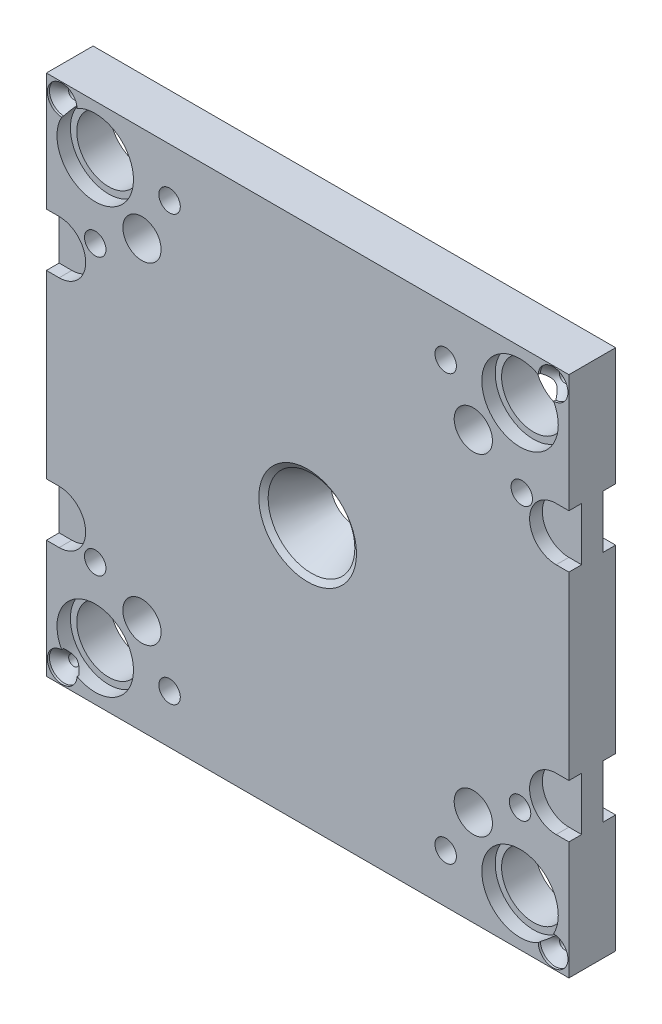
ISO-10303-21;
HEADER;
FILE_DESCRIPTION(('STEP AP214'),'2;1');
FILE_NAME('part.step','',(''),(''),'','','');
FILE_SCHEMA(('AUTOMOTIVE_DESIGN { 1 0 10303 214 1 1 1 1 }'));
ENDSEC;
DATA;
#1=APPLICATION_CONTEXT('core data for automotive mechanical design processes');
#2=APPLICATION_PROTOCOL_DEFINITION('international standard','automotive_design',2000,#1);
#3=PRODUCT_CONTEXT('',#1,'mechanical');
#4=PRODUCT('Part','Part','',(#3));
#5=PRODUCT_RELATED_PRODUCT_CATEGORY('part','',(#4));
#6=PRODUCT_DEFINITION_FORMATION('','',#4);
#7=PRODUCT_DEFINITION_CONTEXT('part definition',#1,'design');
#8=PRODUCT_DEFINITION('design','',#6,#7);
#9=PRODUCT_DEFINITION_SHAPE('','',#8);
#10=(LENGTH_UNIT() NAMED_UNIT(*) SI_UNIT(.MILLI.,.METRE.));
#11=(NAMED_UNIT(*) PLANE_ANGLE_UNIT() SI_UNIT($,.RADIAN.));
#12=(NAMED_UNIT(*) SI_UNIT($,.STERADIAN.) SOLID_ANGLE_UNIT());
#13=UNCERTAINTY_MEASURE_WITH_UNIT(LENGTH_MEASURE(1.E-05),#10,'distance_accuracy_value','');
#14=(GEOMETRIC_REPRESENTATION_CONTEXT(3) GLOBAL_UNCERTAINTY_ASSIGNED_CONTEXT((#13)) GLOBAL_UNIT_ASSIGNED_CONTEXT((#10,
#11,#12)) REPRESENTATION_CONTEXT('',''));
#15=CARTESIAN_POINT('',(0.,0.,0.));
#16=DIRECTION('',(0.,0.,1.));
#17=DIRECTION('',(1.,0.,0.));
#18=AXIS2_PLACEMENT_3D('',#15,#16,#17);
#19=CARTESIAN_POINT('',(0.,0.,21.9999999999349));
#20=DIRECTION('',(0.,0.,1.00000000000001));
#21=DIRECTION('',(0.,-1.,0.));
#22=AXIS2_PLACEMENT_3D('',#19,#20,#21);
#23=CONICAL_SURFACE('',#22,23.0022152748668,0.959931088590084);
#24=CARTESIAN_POINT('',(0.,0.,20.1873844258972));
#25=DIRECTION('',(0.,0.,1.00000000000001));
#26=DIRECTION('',(0.,-1.,0.));
#27=AXIS2_PLACEMENT_3D('',#24,#25,#26);
#28=CIRCLE('',#27,20.4135319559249);
#29=CARTESIAN_POINT('',(-17.9145596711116,9.7867685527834,20.1873844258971));
#30=VERTEX_POINT('',#29);
#31=EDGE_CURVE('E20',#30,#30,#28,.T.);
#32=ORIENTED_EDGE('',*,*,#31,.F.);
#33=EDGE_LOOP('',(#32));
#34=FACE_BOUND('',#33,.T.);
#35=CARTESIAN_POINT('',(0.,0.,22.0000000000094));
#36=DIRECTION('',(0.,0.,1.00000000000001));
#37=DIRECTION('',(0.,-1.,0.));
#38=AXIS2_PLACEMENT_3D('',#35,#36,#37);
#39=CIRCLE('',#38,23.0022152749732);
#40=CARTESIAN_POINT('',(23.0022152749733,0.,22.0000000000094));
#41=VERTEX_POINT('',#40);
#42=EDGE_CURVE('E396',#41,#41,#39,.T.);
#43=ORIENTED_EDGE('',*,*,#42,.T.);
#44=EDGE_LOOP('',(#43));
#45=FACE_BOUND('',#44,.T.);
#46=ADVANCED_FACE('F16',(#34,#45),#23,.F.);
#47=CARTESIAN_POINT('',(0.,0.,22.0000000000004));
#48=DIRECTION('',(0.,0.,1.00000000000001));
#49=DIRECTION('',(1.00000000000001,0.,0.));
#50=AXIS2_PLACEMENT_3D('',#47,#48,#49);
#51=PLANE('',#50);
#52=CARTESIAN_POINT('',(-100.000000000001,-100.,22.0000000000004));
#53=DIRECTION('',(0.,0.,1.00000000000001));
#54=DIRECTION('',(1.00000000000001,0.,0.));
#55=AXIS2_PLACEMENT_3D('',#52,#53,#54);
#56=CIRCLE('',#55,18.);
#57=CARTESIAN_POINT('',(-108.561503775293,-115.833529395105,22.0000000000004));
#58=VERTEX_POINT('',#57);
#59=CARTESIAN_POINT('',(-115.833529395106,-108.561503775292,22.0000000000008));
#60=VERTEX_POINT('',#59);
#61=EDGE_CURVE('E400',#58,#60,#56,.T.);
#62=ORIENTED_EDGE('',*,*,#61,.F.);
#63=CARTESIAN_POINT('',(-115.556000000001,-115.556,22.0000000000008));
#64=DIRECTION('',(0.,0.,1.00000000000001));
#65=DIRECTION('',(1.00000000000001,0.,0.));
#66=AXIS2_PLACEMENT_3D('',#63,#64,#65);
#67=CIRCLE('',#66,7.);
#68=EDGE_CURVE('E402',#60,#58,#67,.T.);
#69=ORIENTED_EDGE('',*,*,#68,.F.);
#70=EDGE_LOOP('',(#62,#69));
#71=FACE_BOUND('',#70,.T.);
#72=CARTESIAN_POINT('',(100.000000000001,-100.,22.0000000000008));
#73=DIRECTION('',(0.,0.,1.00000000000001));
#74=DIRECTION('',(1.00000000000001,0.,0.));
#75=AXIS2_PLACEMENT_3D('',#72,#73,#74);
#76=CIRCLE('',#75,18.);
#77=CARTESIAN_POINT('',(115.833529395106,-108.561503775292,22.0000000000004));
#78=VERTEX_POINT('',#77);
#79=CARTESIAN_POINT('',(108.561503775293,-115.833529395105,22.0000000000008));
#80=VERTEX_POINT('',#79);
#81=EDGE_CURVE('E407',#78,#80,#76,.T.);
#82=ORIENTED_EDGE('',*,*,#81,.F.);
#83=CARTESIAN_POINT('',(115.556000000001,-115.556,22.0000000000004));
#84=DIRECTION('',(0.,0.,1.00000000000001));
#85=DIRECTION('',(1.00000000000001,0.,0.));
#86=AXIS2_PLACEMENT_3D('',#83,#84,#85);
#87=CIRCLE('',#86,7.);
#88=EDGE_CURVE('E409',#80,#78,#87,.T.);
#89=ORIENTED_EDGE('',*,*,#88,.F.);
#90=EDGE_LOOP('',(#82,#89));
#91=FACE_BOUND('',#90,.T.);
#92=CARTESIAN_POINT('',(-100.000000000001,100.,22.0000000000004));
#93=DIRECTION('',(0.,0.,1.00000000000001));
#94=DIRECTION('',(1.00000000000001,0.,0.));
#95=AXIS2_PLACEMENT_3D('',#92,#93,#94);
#96=CIRCLE('',#95,18.);
#97=CARTESIAN_POINT('',(-115.833529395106,108.561503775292,22.0000000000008));
#98=VERTEX_POINT('',#97);
#99=CARTESIAN_POINT('',(-108.561503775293,115.833529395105,22.0000000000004));
#100=VERTEX_POINT('',#99);
#101=EDGE_CURVE('E412',#98,#100,#96,.T.);
#102=ORIENTED_EDGE('',*,*,#101,.F.);
#103=CARTESIAN_POINT('',(-115.556000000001,115.556,22.0000000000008));
#104=DIRECTION('',(0.,0.,1.00000000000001));
#105=DIRECTION('',(1.00000000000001,0.,0.));
#106=AXIS2_PLACEMENT_3D('',#103,#104,#105);
#107=CIRCLE('',#106,7.);
#108=EDGE_CURVE('E414',#100,#98,#107,.T.);
#109=ORIENTED_EDGE('',*,*,#108,.F.);
#110=EDGE_LOOP('',(#102,#109));
#111=FACE_BOUND('',#110,.T.);
#112=CARTESIAN_POINT('',(100.000000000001,100.,22.0000000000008));
#113=DIRECTION('',(0.,0.,1.00000000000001));
#114=DIRECTION('',(1.00000000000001,0.,0.));
#115=AXIS2_PLACEMENT_3D('',#112,#113,#114);
#116=CIRCLE('',#115,18.);
#117=CARTESIAN_POINT('',(108.561503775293,115.833529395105,22.0000000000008));
#118=VERTEX_POINT('',#117);
#119=CARTESIAN_POINT('',(115.833529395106,108.561503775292,22.0000000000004));
#120=VERTEX_POINT('',#119);
#121=EDGE_CURVE('E417',#118,#120,#116,.T.);
#122=ORIENTED_EDGE('',*,*,#121,.F.);
#123=CARTESIAN_POINT('',(115.556000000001,115.556,22.0000000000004));
#124=DIRECTION('',(0.,0.,1.00000000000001));
#125=DIRECTION('',(1.00000000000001,0.,0.));
#126=AXIS2_PLACEMENT_3D('',#123,#124,#125);
#127=CIRCLE('',#126,7.);
#128=EDGE_CURVE('E419',#120,#118,#127,.T.);
#129=ORIENTED_EDGE('',*,*,#128,.F.);
#130=EDGE_LOOP('',(#122,#129));
#131=FACE_BOUND('',#130,.T.);
#132=CARTESIAN_POINT('',(78.0000000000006,78.,22.0000000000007));
#133=DIRECTION('',(0.,0.,1.00000000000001));
#134=DIRECTION('',(1.00000000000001,0.,0.));
#135=AXIS2_PLACEMENT_3D('',#132,#133,#134);
#136=CIRCLE('',#135,9.);
#137=CARTESIAN_POINT('',(87.0000000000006,78.,22.0000000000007));
#138=VERTEX_POINT('',#137);
#139=EDGE_CURVE('E422',#138,#138,#136,.T.);
#140=ORIENTED_EDGE('',*,*,#139,.F.);
#141=EDGE_LOOP('',(#140));
#142=FACE_BOUND('',#141,.T.);
#143=CARTESIAN_POINT('',(-78.0000000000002,78.,22.0000000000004));
#144=DIRECTION('',(0.,0.,1.00000000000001));
#145=DIRECTION('',(1.00000000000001,0.,0.));
#146=AXIS2_PLACEMENT_3D('',#143,#144,#145);
#147=CIRCLE('',#146,9.);
#148=CARTESIAN_POINT('',(-69.0000000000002,78.,22.0000000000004));
#149=VERTEX_POINT('',#148);
#150=EDGE_CURVE('E425',#149,#149,#147,.T.);
#151=ORIENTED_EDGE('',*,*,#150,.F.);
#152=EDGE_LOOP('',(#151));
#153=FACE_BOUND('',#152,.T.);
#154=CARTESIAN_POINT('',(78.0000000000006,-78.,22.0000000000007));
#155=DIRECTION('',(0.,0.,1.00000000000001));
#156=DIRECTION('',(1.00000000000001,0.,0.));
#157=AXIS2_PLACEMENT_3D('',#154,#155,#156);
#158=CIRCLE('',#157,9.);
#159=CARTESIAN_POINT('',(87.0000000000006,-78.,22.0000000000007));
#160=VERTEX_POINT('',#159);
#161=EDGE_CURVE('E428',#160,#160,#158,.T.);
#162=ORIENTED_EDGE('',*,*,#161,.F.);
#163=EDGE_LOOP('',(#162));
#164=FACE_BOUND('',#163,.T.);
#165=CARTESIAN_POINT('',(-78.0000000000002,-78.,22.0000000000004));
#166=DIRECTION('',(0.,0.,1.00000000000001));
#167=DIRECTION('',(1.00000000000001,0.,0.));
#168=AXIS2_PLACEMENT_3D('',#165,#166,#167);
#169=CIRCLE('',#168,9.);
#170=CARTESIAN_POINT('',(-69.0000000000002,-78.,22.0000000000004));
#171=VERTEX_POINT('',#170);
#172=EDGE_CURVE('E431',#171,#171,#169,.T.);
#173=ORIENTED_EDGE('',*,*,#172,.F.);
#174=EDGE_LOOP('',(#173));
#175=FACE_BOUND('',#174,.T.);
#176=ORIENTED_EDGE('',*,*,#42,.F.);
#177=EDGE_LOOP('',(#176));
#178=FACE_BOUND('',#177,.T.);
#179=CARTESIAN_POINT('',(-100.000000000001,-65.,22.0000000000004));
#180=DIRECTION('',(0.,0.,-1.00000000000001));
#181=DIRECTION('',(0.,1.,0.));
#182=AXIS2_PLACEMENT_3D('',#179,#180,#181);
#183=CIRCLE('',#182,5.053);
#184=CARTESIAN_POINT('',(-100.000000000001,-59.947,22.0000000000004));
#185=VERTEX_POINT('',#184);
#186=EDGE_CURVE('E434',#185,#185,#183,.T.);
#187=ORIENTED_EDGE('',*,*,#186,.T.);
#188=EDGE_LOOP('',(#187));
#189=FACE_BOUND('',#188,.T.);
#190=CARTESIAN_POINT('',(100.000000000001,-65.,22.0000000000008));
#191=DIRECTION('',(0.,0.,-1.00000000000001));
#192=DIRECTION('',(-1.00000000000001,0.,0.));
#193=AXIS2_PLACEMENT_3D('',#190,#191,#192);
#194=CIRCLE('',#193,5.053);
#195=CARTESIAN_POINT('',(94.947000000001,-65.,22.0000000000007));
#196=VERTEX_POINT('',#195);
#197=EDGE_CURVE('E437',#196,#196,#194,.T.);
#198=ORIENTED_EDGE('',*,*,#197,.T.);
#199=EDGE_LOOP('',(#198));
#200=FACE_BOUND('',#199,.T.);
#201=CARTESIAN_POINT('',(65.0000000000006,-100.,22.0000000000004));
#202=DIRECTION('',(0.,0.,1.00000000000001));
#203=DIRECTION('',(1.00000000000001,0.,0.));
#204=AXIS2_PLACEMENT_3D('',#201,#202,#203);
#205=CIRCLE('',#204,5.053);
#206=CARTESIAN_POINT('',(70.0530000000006,-100.,22.0000000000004));
#207=VERTEX_POINT('',#206);
#208=EDGE_CURVE('E440',#207,#207,#205,.T.);
#209=ORIENTED_EDGE('',*,*,#208,.F.);
#210=EDGE_LOOP('',(#209));
#211=FACE_BOUND('',#210,.T.);
#212=CARTESIAN_POINT('',(-65.0000000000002,-100.,22.0000000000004));
#213=DIRECTION('',(0.,0.,1.00000000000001));
#214=DIRECTION('',(1.00000000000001,0.,0.));
#215=AXIS2_PLACEMENT_3D('',#212,#213,#214);
#216=CIRCLE('',#215,5.053);
#217=CARTESIAN_POINT('',(-59.9470000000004,-100.,22.0000000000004));
#218=VERTEX_POINT('',#217);
#219=EDGE_CURVE('E443',#218,#218,#216,.T.);
#220=ORIENTED_EDGE('',*,*,#219,.F.);
#221=EDGE_LOOP('',(#220));
#222=FACE_BOUND('',#221,.T.);
#223=CARTESIAN_POINT('',(65.0000000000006,100.,22.0000000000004));
#224=DIRECTION('',(0.,0.,1.00000000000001));
#225=DIRECTION('',(1.00000000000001,0.,0.));
#226=AXIS2_PLACEMENT_3D('',#223,#224,#225);
#227=CIRCLE('',#226,5.053);
#228=CARTESIAN_POINT('',(70.0530000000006,100.,22.0000000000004));
#229=VERTEX_POINT('',#228);
#230=EDGE_CURVE('E446',#229,#229,#227,.T.);
#231=ORIENTED_EDGE('',*,*,#230,.F.);
#232=EDGE_LOOP('',(#231));
#233=FACE_BOUND('',#232,.T.);
#234=CARTESIAN_POINT('',(-65.0000000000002,100.,22.0000000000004));
#235=DIRECTION('',(0.,0.,1.00000000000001));
#236=DIRECTION('',(1.00000000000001,0.,0.));
#237=AXIS2_PLACEMENT_3D('',#234,#235,#236);
#238=CIRCLE('',#237,5.053);
#239=CARTESIAN_POINT('',(-59.9470000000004,100.,22.0000000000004));
#240=VERTEX_POINT('',#239);
#241=EDGE_CURVE('E449',#240,#240,#238,.T.);
#242=ORIENTED_EDGE('',*,*,#241,.F.);
#243=EDGE_LOOP('',(#242));
#244=FACE_BOUND('',#243,.T.);
#245=DIRECTION('',(0.,1.,0.));
#246=VECTOR('',#245,1.);
#247=CARTESIAN_POINT('',(-123.000000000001,95.25,22.0000000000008));
#248=LINE('',#247,#246);
#249=CARTESIAN_POINT('',(-123.000000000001,67.5,21.9999998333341));
#250=VERTEX_POINT('',#249);
#251=CARTESIAN_POINT('',(-123.000000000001,122.999999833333,21.9999998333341));
#252=VERTEX_POINT('',#251);
#253=EDGE_CURVE('E452',#250,#252,#248,.T.);
#254=ORIENTED_EDGE('',*,*,#253,.F.);
#255=DIRECTION('',(1.00000000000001,0.,0.));
#256=VECTOR('',#255,1.);
#257=CARTESIAN_POINT('',(-120.000000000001,67.5,22.0000000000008));
#258=LINE('',#257,#256);
#259=CARTESIAN_POINT('',(-117.000000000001,67.5,22.0000000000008));
#260=VERTEX_POINT('',#259);
#261=EDGE_CURVE('E454',#250,#260,#258,.T.);
#262=ORIENTED_EDGE('',*,*,#261,.T.);
#263=CARTESIAN_POINT('',(-117.000000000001,55.,22.0000000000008));
#264=DIRECTION('',(0.,0.,1.00000000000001));
#265=DIRECTION('',(1.00000000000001,0.,0.));
#266=AXIS2_PLACEMENT_3D('',#263,#264,#265);
#267=CIRCLE('',#266,12.5);
#268=CARTESIAN_POINT('',(-117.000000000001,42.5,22.0000000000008));
#269=VERTEX_POINT('',#268);
#270=EDGE_CURVE('E456',#269,#260,#267,.T.);
#271=ORIENTED_EDGE('',*,*,#270,.F.);
#272=DIRECTION('',(1.00000000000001,0.,0.));
#273=VECTOR('',#272,1.);
#274=CARTESIAN_POINT('',(-120.000000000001,42.5,22.0000000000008));
#275=LINE('',#274,#273);
#276=CARTESIAN_POINT('',(-123.000000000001,42.4999998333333,22.0000000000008));
#277=VERTEX_POINT('',#276);
#278=EDGE_CURVE('E459',#277,#269,#275,.T.);
#279=ORIENTED_EDGE('',*,*,#278,.F.);
#280=DIRECTION('',(0.,1.,0.));
#281=VECTOR('',#280,1.);
#282=CARTESIAN_POINT('',(-123.000000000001,0.,22.0000000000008));
#283=LINE('',#282,#281);
#284=CARTESIAN_POINT('',(-123.000000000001,-42.5,21.9999998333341));
#285=VERTEX_POINT('',#284);
#286=EDGE_CURVE('E462',#285,#277,#283,.T.);
#287=ORIENTED_EDGE('',*,*,#286,.F.);
#288=DIRECTION('',(1.00000000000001,0.,0.));
#289=VECTOR('',#288,1.);
#290=CARTESIAN_POINT('',(-120.000000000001,-42.5,22.0000000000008));
#291=LINE('',#290,#289);
#292=CARTESIAN_POINT('',(-117.000000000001,-42.5,22.0000000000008));
#293=VERTEX_POINT('',#292);
#294=EDGE_CURVE('E465',#285,#293,#291,.T.);
#295=ORIENTED_EDGE('',*,*,#294,.T.);
#296=CARTESIAN_POINT('',(-117.000000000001,-55.,22.0000000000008));
#297=DIRECTION('',(0.,0.,1.00000000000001));
#298=DIRECTION('',(1.00000000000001,0.,0.));
#299=AXIS2_PLACEMENT_3D('',#296,#297,#298);
#300=CIRCLE('',#299,12.5);
#301=CARTESIAN_POINT('',(-117.000000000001,-67.5,22.0000000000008));
#302=VERTEX_POINT('',#301);
#303=EDGE_CURVE('E467',#302,#293,#300,.T.);
#304=ORIENTED_EDGE('',*,*,#303,.F.);
#305=DIRECTION('',(1.00000000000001,0.,0.));
#306=VECTOR('',#305,1.);
#307=CARTESIAN_POINT('',(-120.000000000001,-67.5,22.0000000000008));
#308=LINE('',#307,#306);
#309=CARTESIAN_POINT('',(-123.000000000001,-67.5000001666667,22.0000000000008));
#310=VERTEX_POINT('',#309);
#311=EDGE_CURVE('E470',#310,#302,#308,.T.);
#312=ORIENTED_EDGE('',*,*,#311,.F.);
#313=DIRECTION('',(0.,1.,0.));
#314=VECTOR('',#313,1.);
#315=CARTESIAN_POINT('',(-123.000000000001,-95.25,22.0000000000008));
#316=LINE('',#315,#314);
#317=CARTESIAN_POINT('',(-123.000000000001,-123.,21.9999998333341));
#318=VERTEX_POINT('',#317);
#319=EDGE_CURVE('E473',#318,#310,#316,.T.);
#320=ORIENTED_EDGE('',*,*,#319,.F.);
#321=DIRECTION('',(1.00000000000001,0.,0.));
#322=VECTOR('',#321,1.);
#323=CARTESIAN_POINT('',(0.,-123.,22.0000000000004));
#324=LINE('',#323,#322);
#325=CARTESIAN_POINT('',(123.000000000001,-123.,22.0000000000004));
#326=VERTEX_POINT('',#325);
#327=EDGE_CURVE('E476',#318,#326,#324,.T.);
#328=ORIENTED_EDGE('',*,*,#327,.T.);
#329=DIRECTION('',(0.,1.,0.));
#330=VECTOR('',#329,1.);
#331=CARTESIAN_POINT('',(123.000000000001,-95.25,22.0000000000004));
#332=LINE('',#331,#330);
#333=CARTESIAN_POINT('',(122.999999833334,-67.5,22.0000000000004));
#334=VERTEX_POINT('',#333);
#335=EDGE_CURVE('E478',#326,#334,#332,.T.);
#336=ORIENTED_EDGE('',*,*,#335,.T.);
#337=DIRECTION('',(1.00000000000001,0.,0.));
#338=VECTOR('',#337,1.);
#339=CARTESIAN_POINT('',(120.000000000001,-67.5,22.0000000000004));
#340=LINE('',#339,#338);
#341=CARTESIAN_POINT('',(117.000000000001,-67.5,22.0000000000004));
#342=VERTEX_POINT('',#341);
#343=EDGE_CURVE('E480',#342,#334,#340,.T.);
#344=ORIENTED_EDGE('',*,*,#343,.F.);
#345=CARTESIAN_POINT('',(117.000000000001,-55.,22.0000000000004));
#346=DIRECTION('',(0.,0.,1.00000000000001));
#347=DIRECTION('',(1.00000000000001,0.,0.));
#348=AXIS2_PLACEMENT_3D('',#345,#346,#347);
#349=CIRCLE('',#348,12.5);
#350=CARTESIAN_POINT('',(117.000000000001,-42.5,22.0000000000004));
#351=VERTEX_POINT('',#350);
#352=EDGE_CURVE('E483',#351,#342,#349,.T.);
#353=ORIENTED_EDGE('',*,*,#352,.F.);
#354=DIRECTION('',(1.00000000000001,0.,0.));
#355=VECTOR('',#354,1.);
#356=CARTESIAN_POINT('',(120.000000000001,-42.5,22.0000000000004));
#357=LINE('',#356,#355);
#358=CARTESIAN_POINT('',(123.000000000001,-42.5,22.0000000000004));
#359=VERTEX_POINT('',#358);
#360=EDGE_CURVE('E486',#351,#359,#357,.T.);
#361=ORIENTED_EDGE('',*,*,#360,.T.);
#362=DIRECTION('',(0.,1.,0.));
#363=VECTOR('',#362,1.);
#364=CARTESIAN_POINT('',(123.000000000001,0.,22.0000000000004));
#365=LINE('',#364,#363);
#366=CARTESIAN_POINT('',(122.999999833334,42.5,22.0000000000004));
#367=VERTEX_POINT('',#366);
#368=EDGE_CURVE('E488',#359,#367,#365,.T.);
#369=ORIENTED_EDGE('',*,*,#368,.T.);
#370=DIRECTION('',(1.00000000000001,0.,0.));
#371=VECTOR('',#370,1.);
#372=CARTESIAN_POINT('',(120.000000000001,42.5,22.0000000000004));
#373=LINE('',#372,#371);
#374=CARTESIAN_POINT('',(117.000000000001,42.5,22.0000000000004));
#375=VERTEX_POINT('',#374);
#376=EDGE_CURVE('E490',#375,#367,#373,.T.);
#377=ORIENTED_EDGE('',*,*,#376,.F.);
#378=CARTESIAN_POINT('',(117.000000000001,55.,22.0000000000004));
#379=DIRECTION('',(0.,0.,1.00000000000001));
#380=DIRECTION('',(1.00000000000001,0.,0.));
#381=AXIS2_PLACEMENT_3D('',#378,#379,#380);
#382=CIRCLE('',#381,12.5);
#383=CARTESIAN_POINT('',(117.000000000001,67.5,22.0000000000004));
#384=VERTEX_POINT('',#383);
#385=EDGE_CURVE('E493',#384,#375,#382,.T.);
#386=ORIENTED_EDGE('',*,*,#385,.F.);
#387=DIRECTION('',(1.00000000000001,0.,0.));
#388=VECTOR('',#387,1.);
#389=CARTESIAN_POINT('',(120.000000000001,67.5,22.0000000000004));
#390=LINE('',#389,#388);
#391=CARTESIAN_POINT('',(123.000000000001,67.5,22.0000000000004));
#392=VERTEX_POINT('',#391);
#393=EDGE_CURVE('E496',#384,#392,#390,.T.);
#394=ORIENTED_EDGE('',*,*,#393,.T.);
#395=DIRECTION('',(0.,1.,0.));
#396=VECTOR('',#395,1.);
#397=CARTESIAN_POINT('',(123.000000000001,95.25,22.0000000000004));
#398=LINE('',#397,#396);
#399=CARTESIAN_POINT('',(122.999999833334,123.,22.0000000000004));
#400=VERTEX_POINT('',#399);
#401=EDGE_CURVE('E498',#392,#400,#398,.T.);
#402=ORIENTED_EDGE('',*,*,#401,.T.);
#403=DIRECTION('',(1.00000000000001,0.,0.));
#404=VECTOR('',#403,1.);
#405=CARTESIAN_POINT('',(0.,123.,22.0000000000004));
#406=LINE('',#405,#404);
#407=EDGE_CURVE('E500',#252,#400,#406,.T.);
#408=ORIENTED_EDGE('',*,*,#407,.F.);
#409=EDGE_LOOP('',(#254,#262,#271,#279,#287,#295,#304,#312,#320,#328,#336,#344,#353,#361,#369,
#377,#386,#394,#402,#408));
#410=FACE_BOUND('',#409,.T.);
#411=CARTESIAN_POINT('',(100.814049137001,63.7301145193,22.0000000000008));
#412=DIRECTION('',(0.,0.,-1.00000000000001));
#413=DIRECTION('',(-1.00000000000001,0.,0.));
#414=AXIS2_PLACEMENT_3D('',#411,#412,#413);
#415=CIRCLE('',#414,5.053);
#416=CARTESIAN_POINT('',(95.761049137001,63.7301145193,22.0000000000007));
#417=VERTEX_POINT('',#416);
#418=EDGE_CURVE('E503',#417,#417,#415,.T.);
#419=ORIENTED_EDGE('',*,*,#418,.T.);
#420=EDGE_LOOP('',(#419));
#421=FACE_BOUND('',#420,.T.);
#422=CARTESIAN_POINT('',(-100.000000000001,65.,22.0000000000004));
#423=DIRECTION('',(0.,0.,-1.00000000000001));
#424=DIRECTION('',(-1.00000000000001,0.,0.));
#425=AXIS2_PLACEMENT_3D('',#422,#423,#424);
#426=CIRCLE('',#425,5.053);
#427=CARTESIAN_POINT('',(-105.053000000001,65.,22.0000000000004));
#428=VERTEX_POINT('',#427);
#429=EDGE_CURVE('E506',#428,#428,#426,.T.);
#430=ORIENTED_EDGE('',*,*,#429,.T.);
#431=EDGE_LOOP('',(#430));
#432=FACE_BOUND('',#431,.T.);
#433=ADVANCED_FACE('F397',(#71,#91,#111,#131,#142,#153,#164,#175,#178,#189,#200,#211,#222,#233,
#244,#410,#421,#432),#51,.T.);
#434=CARTESIAN_POINT('',(0.,0.,0.));
#435=DIRECTION('',(0.,0.,1.00000000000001));
#436=DIRECTION('',(1.00000000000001,0.,0.));
#437=AXIS2_PLACEMENT_3D('',#434,#435,#436);
#438=PLANE('',#437);
#439=CARTESIAN_POINT('',(100.000000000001,100.,0.));
#440=DIRECTION('',(0.,0.,1.00000000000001));
#441=DIRECTION('',(1.00000000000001,0.,0.));
#442=AXIS2_PLACEMENT_3D('',#439,#440,#441);
#443=CIRCLE('',#442,15.);
#444=CARTESIAN_POINT('',(115.000000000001,100.,0.));
#445=VERTEX_POINT('',#444);
#446=EDGE_CURVE('E509',#445,#445,#443,.F.);
#447=ORIENTED_EDGE('',*,*,#446,.F.);
#448=EDGE_LOOP('',(#447));
#449=FACE_BOUND('',#448,.T.);
#450=CARTESIAN_POINT('',(-100.000000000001,100.,0.));
#451=DIRECTION('',(0.,0.,1.00000000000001));
#452=DIRECTION('',(1.00000000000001,0.,0.));
#453=AXIS2_PLACEMENT_3D('',#450,#451,#452);
#454=CIRCLE('',#453,15.);
#455=CARTESIAN_POINT('',(-85.0000000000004,100.,0.));
#456=VERTEX_POINT('',#455);
#457=EDGE_CURVE('E512',#456,#456,#454,.F.);
#458=ORIENTED_EDGE('',*,*,#457,.F.);
#459=EDGE_LOOP('',(#458));
#460=FACE_BOUND('',#459,.T.);
#461=CARTESIAN_POINT('',(100.000000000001,-100.,0.));
#462=DIRECTION('',(0.,0.,1.00000000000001));
#463=DIRECTION('',(1.00000000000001,0.,0.));
#464=AXIS2_PLACEMENT_3D('',#461,#462,#463);
#465=CIRCLE('',#464,15.);
#466=CARTESIAN_POINT('',(115.000000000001,-100.,0.));
#467=VERTEX_POINT('',#466);
#468=EDGE_CURVE('E515',#467,#467,#465,.F.);
#469=ORIENTED_EDGE('',*,*,#468,.F.);
#470=EDGE_LOOP('',(#469));
#471=FACE_BOUND('',#470,.T.);
#472=CARTESIAN_POINT('',(-100.000000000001,-100.,0.));
#473=DIRECTION('',(0.,0.,1.00000000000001));
#474=DIRECTION('',(1.00000000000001,0.,0.));
#475=AXIS2_PLACEMENT_3D('',#472,#473,#474);
#476=CIRCLE('',#475,15.);
#477=CARTESIAN_POINT('',(-85.0000000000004,-100.,0.));
#478=VERTEX_POINT('',#477);
#479=EDGE_CURVE('E518',#478,#478,#476,.F.);
#480=ORIENTED_EDGE('',*,*,#479,.F.);
#481=EDGE_LOOP('',(#480));
#482=FACE_BOUND('',#481,.T.);
#483=CARTESIAN_POINT('',(78.0000000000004,78.,0.));
#484=DIRECTION('',(0.,0.,1.00000000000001));
#485=DIRECTION('',(1.00000000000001,0.,0.));
#486=AXIS2_PLACEMENT_3D('',#483,#484,#485);
#487=CIRCLE('',#486,9.);
#488=CARTESIAN_POINT('',(87.0000000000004,78.,0.));
#489=VERTEX_POINT('',#488);
#490=EDGE_CURVE('E521',#489,#489,#487,.F.);
#491=ORIENTED_EDGE('',*,*,#490,.F.);
#492=EDGE_LOOP('',(#491));
#493=FACE_BOUND('',#492,.T.);
#494=CARTESIAN_POINT('',(-78.0000000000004,78.,0.));
#495=DIRECTION('',(0.,0.,1.00000000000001));
#496=DIRECTION('',(1.00000000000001,0.,0.));
#497=AXIS2_PLACEMENT_3D('',#494,#495,#496);
#498=CIRCLE('',#497,9.);
#499=CARTESIAN_POINT('',(-69.0000000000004,78.,0.));
#500=VERTEX_POINT('',#499);
#501=EDGE_CURVE('E524',#500,#500,#498,.F.);
#502=ORIENTED_EDGE('',*,*,#501,.F.);
#503=EDGE_LOOP('',(#502));
#504=FACE_BOUND('',#503,.T.);
#505=CARTESIAN_POINT('',(78.0000000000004,-78.,0.));
#506=DIRECTION('',(0.,0.,1.00000000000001));
#507=DIRECTION('',(1.00000000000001,0.,0.));
#508=AXIS2_PLACEMENT_3D('',#505,#506,#507);
#509=CIRCLE('',#508,9.);
#510=CARTESIAN_POINT('',(87.0000000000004,-78.,0.));
#511=VERTEX_POINT('',#510);
#512=EDGE_CURVE('E527',#511,#511,#509,.F.);
#513=ORIENTED_EDGE('',*,*,#512,.F.);
#514=EDGE_LOOP('',(#513));
#515=FACE_BOUND('',#514,.T.);
#516=CARTESIAN_POINT('',(-78.0000000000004,-78.,0.));
#517=DIRECTION('',(0.,0.,1.00000000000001));
#518=DIRECTION('',(1.00000000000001,0.,0.));
#519=AXIS2_PLACEMENT_3D('',#516,#517,#518);
#520=CIRCLE('',#519,9.);
#521=CARTESIAN_POINT('',(-69.0000000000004,-78.,0.));
#522=VERTEX_POINT('',#521);
#523=EDGE_CURVE('E530',#522,#522,#520,.F.);
#524=ORIENTED_EDGE('',*,*,#523,.F.);
#525=EDGE_LOOP('',(#524));
#526=FACE_BOUND('',#525,.T.);
#527=CARTESIAN_POINT('',(0.,0.,-6.93889390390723E-13));
#528=DIRECTION('',(0.,0.,1.00000000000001));
#529=DIRECTION('',(0.,-1.,0.));
#530=AXIS2_PLACEMENT_3D('',#527,#528,#529);
#531=CIRCLE('',#530,10.9999999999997);
#532=CARTESIAN_POINT('',(0.,-10.9999999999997,-6.93889390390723E-13));
#533=VERTEX_POINT('',#532);
#534=EDGE_CURVE('E11',#533,#533,#531,.T.);
#535=ORIENTED_EDGE('',*,*,#534,.T.);
#536=EDGE_LOOP('',(#535));
#537=FACE_BOUND('',#536,.T.);
#538=CARTESIAN_POINT('',(-100.000000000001,-65.,0.));
#539=DIRECTION('',(0.,0.,-1.00000000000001));
#540=DIRECTION('',(0.,1.,0.));
#541=AXIS2_PLACEMENT_3D('',#538,#539,#540);
#542=CIRCLE('',#541,5.053);
#543=CARTESIAN_POINT('',(-100.000000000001,-59.947,0.));
#544=VERTEX_POINT('',#543);
#545=EDGE_CURVE('E533',#544,#544,#542,.T.);
#546=ORIENTED_EDGE('',*,*,#545,.F.);
#547=EDGE_LOOP('',(#546));
#548=FACE_BOUND('',#547,.T.);
#549=CARTESIAN_POINT('',(100.000000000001,-65.,0.));
#550=DIRECTION('',(0.,0.,-1.00000000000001));
#551=DIRECTION('',(-1.00000000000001,0.,0.));
#552=AXIS2_PLACEMENT_3D('',#549,#550,#551);
#553=CIRCLE('',#552,5.053);
#554=CARTESIAN_POINT('',(94.9470000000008,-65.,0.));
#555=VERTEX_POINT('',#554);
#556=EDGE_CURVE('E536',#555,#555,#553,.T.);
#557=ORIENTED_EDGE('',*,*,#556,.F.);
#558=EDGE_LOOP('',(#557));
#559=FACE_BOUND('',#558,.T.);
#560=CARTESIAN_POINT('',(65.0000000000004,-100.,0.));
#561=DIRECTION('',(0.,0.,1.00000000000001));
#562=DIRECTION('',(1.00000000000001,0.,0.));
#563=AXIS2_PLACEMENT_3D('',#560,#561,#562);
#564=CIRCLE('',#563,5.053);
#565=CARTESIAN_POINT('',(70.0530000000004,-100.,0.));
#566=VERTEX_POINT('',#565);
#567=EDGE_CURVE('E539',#566,#566,#564,.F.);
#568=ORIENTED_EDGE('',*,*,#567,.F.);
#569=EDGE_LOOP('',(#568));
#570=FACE_BOUND('',#569,.T.);
#571=CARTESIAN_POINT('',(-65.0000000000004,-100.,0.));
#572=DIRECTION('',(0.,0.,1.00000000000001));
#573=DIRECTION('',(1.00000000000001,0.,0.));
#574=AXIS2_PLACEMENT_3D('',#571,#572,#573);
#575=CIRCLE('',#574,5.053);
#576=CARTESIAN_POINT('',(-59.9470000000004,-100.,0.));
#577=VERTEX_POINT('',#576);
#578=EDGE_CURVE('E542',#577,#577,#575,.F.);
#579=ORIENTED_EDGE('',*,*,#578,.F.);
#580=EDGE_LOOP('',(#579));
#581=FACE_BOUND('',#580,.T.);
#582=CARTESIAN_POINT('',(65.0000000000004,100.,0.));
#583=DIRECTION('',(0.,0.,1.00000000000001));
#584=DIRECTION('',(1.00000000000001,0.,0.));
#585=AXIS2_PLACEMENT_3D('',#582,#583,#584);
#586=CIRCLE('',#585,5.053);
#587=CARTESIAN_POINT('',(70.0530000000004,100.,0.));
#588=VERTEX_POINT('',#587);
#589=EDGE_CURVE('E545',#588,#588,#586,.F.);
#590=ORIENTED_EDGE('',*,*,#589,.F.);
#591=EDGE_LOOP('',(#590));
#592=FACE_BOUND('',#591,.T.);
#593=CARTESIAN_POINT('',(-65.0000000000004,100.,0.));
#594=DIRECTION('',(0.,0.,1.00000000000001));
#595=DIRECTION('',(1.00000000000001,0.,0.));
#596=AXIS2_PLACEMENT_3D('',#593,#594,#595);
#597=CIRCLE('',#596,5.053);
#598=CARTESIAN_POINT('',(-59.9470000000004,100.,0.));
#599=VERTEX_POINT('',#598);
#600=EDGE_CURVE('E548',#599,#599,#597,.F.);
#601=ORIENTED_EDGE('',*,*,#600,.F.);
#602=EDGE_LOOP('',(#601));
#603=FACE_BOUND('',#602,.T.);
#604=DIRECTION('',(0.,1.,0.));
#605=VECTOR('',#604,1.);
#606=CARTESIAN_POINT('',(-123.000000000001,0.,0.));
#607=LINE('',#606,#605);
#608=CARTESIAN_POINT('',(-123.000000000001,-42.5,0.));
#609=VERTEX_POINT('',#608);
#610=CARTESIAN_POINT('',(-123.000000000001,42.5,1.66666680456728E-07));
#611=VERTEX_POINT('',#610);
#612=EDGE_CURVE('E551',#609,#611,#607,.T.);
#613=ORIENTED_EDGE('',*,*,#612,.T.);
#614=DIRECTION('',(1.00000000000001,0.,0.));
#615=VECTOR('',#614,1.);
#616=CARTESIAN_POINT('',(-120.000000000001,42.5,0.));
#617=LINE('',#616,#615);
#618=CARTESIAN_POINT('',(-117.000000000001,42.5,0.));
#619=VERTEX_POINT('',#618);
#620=EDGE_CURVE('E553',#611,#619,#617,.T.);
#621=ORIENTED_EDGE('',*,*,#620,.T.);
#622=CARTESIAN_POINT('',(-117.000000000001,55.,0.));
#623=DIRECTION('',(0.,0.,1.00000000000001));
#624=DIRECTION('',(1.00000000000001,0.,0.));
#625=AXIS2_PLACEMENT_3D('',#622,#623,#624);
#626=CIRCLE('',#625,12.5);
#627=CARTESIAN_POINT('',(-117.000000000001,67.5,0.));
#628=VERTEX_POINT('',#627);
#629=EDGE_CURVE('E555',#619,#628,#626,.T.);
#630=ORIENTED_EDGE('',*,*,#629,.T.);
#631=DIRECTION('',(1.00000000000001,0.,0.));
#632=VECTOR('',#631,1.);
#633=CARTESIAN_POINT('',(-120.000000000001,67.5,0.));
#634=LINE('',#633,#632);
#635=CARTESIAN_POINT('',(-123.000000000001,67.5,0.));
#636=VERTEX_POINT('',#635);
#637=EDGE_CURVE('E557',#636,#628,#634,.T.);
#638=ORIENTED_EDGE('',*,*,#637,.F.);
#639=DIRECTION('',(0.,1.,0.));
#640=VECTOR('',#639,1.);
#641=CARTESIAN_POINT('',(-123.000000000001,95.25,0.));
#642=LINE('',#641,#640);
#643=CARTESIAN_POINT('',(-123.000000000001,123.,0.));
#644=VERTEX_POINT('',#643);
#645=EDGE_CURVE('E560',#636,#644,#642,.T.);
#646=ORIENTED_EDGE('',*,*,#645,.T.);
#647=DIRECTION('',(1.00000000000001,0.,0.));
#648=VECTOR('',#647,1.);
#649=CARTESIAN_POINT('',(0.,123.,0.));
#650=LINE('',#649,#648);
#651=CARTESIAN_POINT('',(123.000000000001,122.999999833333,1.66666652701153E-07));
#652=VERTEX_POINT('',#651);
#653=EDGE_CURVE('E562',#644,#652,#650,.T.);
#654=ORIENTED_EDGE('',*,*,#653,.T.);
#655=DIRECTION('',(0.,1.,0.));
#656=VECTOR('',#655,1.);
#657=CARTESIAN_POINT('',(123.000000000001,95.25,0.));
#658=LINE('',#657,#656);
#659=CARTESIAN_POINT('',(122.999999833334,67.5,1.66666652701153E-07));
#660=VERTEX_POINT('',#659);
#661=EDGE_CURVE('E564',#660,#652,#658,.T.);
#662=ORIENTED_EDGE('',*,*,#661,.F.);
#663=DIRECTION('',(1.00000000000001,0.,0.));
#664=VECTOR('',#663,1.);
#665=CARTESIAN_POINT('',(120.000000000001,67.5,0.));
#666=LINE('',#665,#664);
#667=CARTESIAN_POINT('',(117.000000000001,67.5,0.));
#668=VERTEX_POINT('',#667);
#669=EDGE_CURVE('E567',#668,#660,#666,.T.);
#670=ORIENTED_EDGE('',*,*,#669,.F.);
#671=CARTESIAN_POINT('',(117.000000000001,55.,0.));
#672=DIRECTION('',(0.,0.,1.00000000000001));
#673=DIRECTION('',(1.00000000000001,0.,0.));
#674=AXIS2_PLACEMENT_3D('',#671,#672,#673);
#675=CIRCLE('',#674,12.5);
#676=CARTESIAN_POINT('',(117.000000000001,42.5,0.));
#677=VERTEX_POINT('',#676);
#678=EDGE_CURVE('E570',#668,#677,#675,.T.);
#679=ORIENTED_EDGE('',*,*,#678,.T.);
#680=DIRECTION('',(1.00000000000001,0.,0.));
#681=VECTOR('',#680,1.);
#682=CARTESIAN_POINT('',(120.000000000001,42.5,0.));
#683=LINE('',#682,#681);
#684=CARTESIAN_POINT('',(123.000000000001,42.4999998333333,0.));
#685=VERTEX_POINT('',#684);
#686=EDGE_CURVE('E572',#677,#685,#683,.T.);
#687=ORIENTED_EDGE('',*,*,#686,.T.);
#688=DIRECTION('',(0.,1.,0.));
#689=VECTOR('',#688,1.);
#690=CARTESIAN_POINT('',(123.000000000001,0.,0.));
#691=LINE('',#690,#689);
#692=CARTESIAN_POINT('',(122.999999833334,-42.5,1.66666652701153E-07));
#693=VERTEX_POINT('',#692);
#694=EDGE_CURVE('E574',#693,#685,#691,.T.);
#695=ORIENTED_EDGE('',*,*,#694,.F.);
#696=DIRECTION('',(1.00000000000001,0.,0.));
#697=VECTOR('',#696,1.);
#698=CARTESIAN_POINT('',(120.000000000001,-42.5,0.));
#699=LINE('',#698,#697);
#700=CARTESIAN_POINT('',(117.000000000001,-42.5,0.));
#701=VERTEX_POINT('',#700);
#702=EDGE_CURVE('E577',#701,#693,#699,.T.);
#703=ORIENTED_EDGE('',*,*,#702,.F.);
#704=CARTESIAN_POINT('',(117.000000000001,-55.,0.));
#705=DIRECTION('',(0.,0.,1.00000000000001));
#706=DIRECTION('',(1.00000000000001,0.,0.));
#707=AXIS2_PLACEMENT_3D('',#704,#705,#706);
#708=CIRCLE('',#707,12.5);
#709=CARTESIAN_POINT('',(117.000000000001,-67.5,0.));
#710=VERTEX_POINT('',#709);
#711=EDGE_CURVE('E580',#701,#710,#708,.T.);
#712=ORIENTED_EDGE('',*,*,#711,.T.);
#713=DIRECTION('',(1.00000000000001,0.,0.));
#714=VECTOR('',#713,1.);
#715=CARTESIAN_POINT('',(120.000000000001,-67.5,0.));
#716=LINE('',#715,#714);
#717=CARTESIAN_POINT('',(123.000000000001,-67.5000001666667,0.));
#718=VERTEX_POINT('',#717);
#719=EDGE_CURVE('E582',#710,#718,#716,.T.);
#720=ORIENTED_EDGE('',*,*,#719,.T.);
#721=DIRECTION('',(0.,1.,0.));
#722=VECTOR('',#721,1.);
#723=CARTESIAN_POINT('',(123.000000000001,-95.25,0.));
#724=LINE('',#723,#722);
#725=CARTESIAN_POINT('',(122.999999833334,-123.,1.66666652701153E-07));
#726=VERTEX_POINT('',#725);
#727=EDGE_CURVE('E584',#726,#718,#724,.T.);
#728=ORIENTED_EDGE('',*,*,#727,.F.);
#729=DIRECTION('',(1.00000000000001,0.,0.));
#730=VECTOR('',#729,1.);
#731=CARTESIAN_POINT('',(0.,-123.,0.));
#732=LINE('',#731,#730);
#733=CARTESIAN_POINT('',(-123.000000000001,-123.,0.));
#734=VERTEX_POINT('',#733);
#735=EDGE_CURVE('E587',#734,#726,#732,.T.);
#736=ORIENTED_EDGE('',*,*,#735,.F.);
#737=DIRECTION('',(0.,1.,0.));
#738=VECTOR('',#737,1.);
#739=CARTESIAN_POINT('',(-123.000000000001,-95.25,0.));
#740=LINE('',#739,#738);
#741=CARTESIAN_POINT('',(-123.000000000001,-67.5,0.));
#742=VERTEX_POINT('',#741);
#743=EDGE_CURVE('E590',#734,#742,#740,.T.);
#744=ORIENTED_EDGE('',*,*,#743,.T.);
#745=DIRECTION('',(1.00000000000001,0.,0.));
#746=VECTOR('',#745,1.);
#747=CARTESIAN_POINT('',(-120.000000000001,-67.5,0.));
#748=LINE('',#747,#746);
#749=CARTESIAN_POINT('',(-117.000000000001,-67.5,0.));
#750=VERTEX_POINT('',#749);
#751=EDGE_CURVE('E592',#742,#750,#748,.T.);
#752=ORIENTED_EDGE('',*,*,#751,.T.);
#753=CARTESIAN_POINT('',(-117.000000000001,-55.,0.));
#754=DIRECTION('',(0.,0.,1.00000000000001));
#755=DIRECTION('',(1.00000000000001,0.,0.));
#756=AXIS2_PLACEMENT_3D('',#753,#754,#755);
#757=CIRCLE('',#756,12.5);
#758=CARTESIAN_POINT('',(-117.000000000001,-42.5,0.));
#759=VERTEX_POINT('',#758);
#760=EDGE_CURVE('E594',#750,#759,#757,.T.);
#761=ORIENTED_EDGE('',*,*,#760,.T.);
#762=DIRECTION('',(1.00000000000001,0.,0.));
#763=VECTOR('',#762,1.);
#764=CARTESIAN_POINT('',(-120.000000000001,-42.5,0.));
#765=LINE('',#764,#763);
#766=EDGE_CURVE('E596',#609,#759,#765,.T.);
#767=ORIENTED_EDGE('',*,*,#766,.F.);
#768=EDGE_LOOP('',(#613,#621,#630,#638,#646,#654,#662,#670,#679,#687,#695,#703,#712,#720,#728,
#736,#744,#752,#761,#767));
#769=FACE_BOUND('',#768,.T.);
#770=CARTESIAN_POINT('',(100.814049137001,63.7301145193,0.));
#771=DIRECTION('',(0.,0.,-1.00000000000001));
#772=DIRECTION('',(-1.00000000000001,0.,0.));
#773=AXIS2_PLACEMENT_3D('',#770,#771,#772);
#774=CIRCLE('',#773,5.053);
#775=CARTESIAN_POINT('',(95.7610491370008,63.7301145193,0.));
#776=VERTEX_POINT('',#775);
#777=EDGE_CURVE('E599',#776,#776,#774,.T.);
#778=ORIENTED_EDGE('',*,*,#777,.F.);
#779=EDGE_LOOP('',(#778));
#780=FACE_BOUND('',#779,.T.);
#781=CARTESIAN_POINT('',(-100.000000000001,65.,0.));
#782=DIRECTION('',(0.,0.,-1.00000000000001));
#783=DIRECTION('',(-1.00000000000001,0.,0.));
#784=AXIS2_PLACEMENT_3D('',#781,#782,#783);
#785=CIRCLE('',#784,5.053);
#786=CARTESIAN_POINT('',(-105.053000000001,65.,0.));
#787=VERTEX_POINT('',#786);
#788=EDGE_CURVE('E602',#787,#787,#785,.T.);
#789=ORIENTED_EDGE('',*,*,#788,.F.);
#790=EDGE_LOOP('',(#789));
#791=FACE_BOUND('',#790,.T.);
#792=ADVANCED_FACE('F995',(#449,#460,#471,#482,#493,#504,#515,#526,#537,#548,#559,#570,#581,
#592,#603,#769,#780,#791),#438,.F.);
#793=CARTESIAN_POINT('',(100.000000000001,100.,10.3399999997));
#794=DIRECTION('',(0.,0.,1.00000000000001));
#795=DIRECTION('',(1.00000000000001,0.,0.));
#796=AXIS2_PLACEMENT_3D('',#793,#794,#795);
#797=CYLINDRICAL_SURFACE('',#796,15.);
#798=ORIENTED_EDGE('',*,*,#446,.T.);
#799=EDGE_LOOP('',(#798));
#800=FACE_BOUND('',#799,.T.);
#801=CARTESIAN_POINT('',(100.000000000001,100.,15.7000000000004));
#802=DIRECTION('',(0.,0.,1.00000000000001));
#803=DIRECTION('',(1.00000000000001,0.,0.));
#804=AXIS2_PLACEMENT_3D('',#801,#802,#803);
#805=CIRCLE('',#804,15.);
#806=CARTESIAN_POINT('',(115.000000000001,100.,15.7000000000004));
#807=VERTEX_POINT('',#806);
#808=EDGE_CURVE('E605',#807,#807,#805,.F.);
#809=ORIENTED_EDGE('',*,*,#808,.F.);
#810=EDGE_LOOP('',(#809));
#811=FACE_BOUND('',#810,.T.);
#812=ADVANCED_FACE('F1012',(#800,#811),#797,.F.);
#813=CARTESIAN_POINT('',(-100.000000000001,100.,10.3399999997));
#814=DIRECTION('',(0.,0.,1.00000000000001));
#815=DIRECTION('',(1.00000000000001,0.,0.));
#816=AXIS2_PLACEMENT_3D('',#813,#814,#815);
#817=CYLINDRICAL_SURFACE('',#816,15.);
#818=ORIENTED_EDGE('',*,*,#457,.T.);
#819=EDGE_LOOP('',(#818));
#820=FACE_BOUND('',#819,.T.);
#821=CARTESIAN_POINT('',(-100.000000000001,100.,15.7));
#822=DIRECTION('',(0.,0.,1.00000000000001));
#823=DIRECTION('',(1.00000000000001,0.,0.));
#824=AXIS2_PLACEMENT_3D('',#821,#822,#823);
#825=CIRCLE('',#824,15.);
#826=CARTESIAN_POINT('',(-85.0000000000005,100.,15.7));
#827=VERTEX_POINT('',#826);
#828=EDGE_CURVE('E608',#827,#827,#825,.F.);
#829=ORIENTED_EDGE('',*,*,#828,.F.);
#830=EDGE_LOOP('',(#829));
#831=FACE_BOUND('',#830,.T.);
#832=ADVANCED_FACE('F1653',(#820,#831),#817,.F.);
#833=CARTESIAN_POINT('',(100.000000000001,-100.,10.3399999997));
#834=DIRECTION('',(0.,0.,1.00000000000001));
#835=DIRECTION('',(1.00000000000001,0.,0.));
#836=AXIS2_PLACEMENT_3D('',#833,#834,#835);
#837=CYLINDRICAL_SURFACE('',#836,15.);
#838=ORIENTED_EDGE('',*,*,#468,.T.);
#839=EDGE_LOOP('',(#838));
#840=FACE_BOUND('',#839,.T.);
#841=CARTESIAN_POINT('',(100.000000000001,-100.,15.7000000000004));
#842=DIRECTION('',(0.,0.,1.00000000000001));
#843=DIRECTION('',(1.00000000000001,0.,0.));
#844=AXIS2_PLACEMENT_3D('',#841,#842,#843);
#845=CIRCLE('',#844,15.);
#846=CARTESIAN_POINT('',(115.000000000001,-100.,15.7000000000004));
#847=VERTEX_POINT('',#846);
#848=EDGE_CURVE('E611',#847,#847,#845,.F.);
#849=ORIENTED_EDGE('',*,*,#848,.F.);
#850=EDGE_LOOP('',(#849));
#851=FACE_BOUND('',#850,.T.);
#852=ADVANCED_FACE('F1645',(#840,#851),#837,.F.);
#853=CARTESIAN_POINT('',(-100.000000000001,-100.,10.3399999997));
#854=DIRECTION('',(0.,0.,1.00000000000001));
#855=DIRECTION('',(1.00000000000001,0.,0.));
#856=AXIS2_PLACEMENT_3D('',#853,#854,#855);
#857=CYLINDRICAL_SURFACE('',#856,15.);
#858=ORIENTED_EDGE('',*,*,#479,.T.);
#859=EDGE_LOOP('',(#858));
#860=FACE_BOUND('',#859,.T.);
#861=CARTESIAN_POINT('',(-100.000000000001,-100.,15.7));
#862=DIRECTION('',(0.,0.,1.00000000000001));
#863=DIRECTION('',(1.00000000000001,0.,0.));
#864=AXIS2_PLACEMENT_3D('',#861,#862,#863);
#865=CIRCLE('',#864,15.);
#866=CARTESIAN_POINT('',(-85.0000000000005,-100.,15.7));
#867=VERTEX_POINT('',#866);
#868=EDGE_CURVE('E614',#867,#867,#865,.F.);
#869=ORIENTED_EDGE('',*,*,#868,.F.);
#870=EDGE_LOOP('',(#869));
#871=FACE_BOUND('',#870,.T.);
#872=ADVANCED_FACE('F1637',(#860,#871),#857,.F.);
#873=CARTESIAN_POINT('',(78.0000000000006,78.,10.3399999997));
#874=DIRECTION('',(0.,0.,1.00000000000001));
#875=DIRECTION('',(1.00000000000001,0.,0.));
#876=AXIS2_PLACEMENT_3D('',#873,#874,#875);
#877=CYLINDRICAL_SURFACE('',#876,9.);
#878=ORIENTED_EDGE('',*,*,#139,.T.);
#879=EDGE_LOOP('',(#878));
#880=FACE_BOUND('',#879,.T.);
#881=ORIENTED_EDGE('',*,*,#490,.T.);
#882=EDGE_LOOP('',(#881));
#883=FACE_BOUND('',#882,.T.);
#884=ADVANCED_FACE('F1629',(#880,#883),#877,.F.);
#885=CARTESIAN_POINT('',(-78.0000000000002,78.,10.3399999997));
#886=DIRECTION('',(0.,0.,1.00000000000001));
#887=DIRECTION('',(1.00000000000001,0.,0.));
#888=AXIS2_PLACEMENT_3D('',#885,#886,#887);
#889=CYLINDRICAL_SURFACE('',#888,9.);
#890=ORIENTED_EDGE('',*,*,#150,.T.);
#891=EDGE_LOOP('',(#890));
#892=FACE_BOUND('',#891,.T.);
#893=ORIENTED_EDGE('',*,*,#501,.T.);
#894=EDGE_LOOP('',(#893));
#895=FACE_BOUND('',#894,.T.);
#896=ADVANCED_FACE('F1621',(#892,#895),#889,.F.);
#897=CARTESIAN_POINT('',(78.0000000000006,-78.,10.3399999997));
#898=DIRECTION('',(0.,0.,1.00000000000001));
#899=DIRECTION('',(1.00000000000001,0.,0.));
#900=AXIS2_PLACEMENT_3D('',#897,#898,#899);
#901=CYLINDRICAL_SURFACE('',#900,9.);
#902=ORIENTED_EDGE('',*,*,#161,.T.);
#903=EDGE_LOOP('',(#902));
#904=FACE_BOUND('',#903,.T.);
#905=ORIENTED_EDGE('',*,*,#512,.T.);
#906=EDGE_LOOP('',(#905));
#907=FACE_BOUND('',#906,.T.);
#908=ADVANCED_FACE('F1007',(#904,#907),#901,.F.);
#909=CARTESIAN_POINT('',(-78.0000000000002,-78.,10.3399999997));
#910=DIRECTION('',(0.,0.,1.00000000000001));
#911=DIRECTION('',(1.00000000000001,0.,0.));
#912=AXIS2_PLACEMENT_3D('',#909,#910,#911);
#913=CYLINDRICAL_SURFACE('',#912,9.);
#914=ORIENTED_EDGE('',*,*,#172,.T.);
#915=EDGE_LOOP('',(#914));
#916=FACE_BOUND('',#915,.T.);
#917=ORIENTED_EDGE('',*,*,#523,.T.);
#918=EDGE_LOOP('',(#917));
#919=FACE_BOUND('',#918,.T.);
#920=ADVANCED_FACE('F1003',(#916,#919),#913,.F.);
#921=CARTESIAN_POINT('',(-100.000000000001,-65.,21.9000000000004));
#922=DIRECTION('',(0.,0.,-1.00000000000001));
#923=DIRECTION('',(0.,1.,0.));
#924=AXIS2_PLACEMENT_3D('',#921,#922,#923);
#925=CYLINDRICAL_SURFACE('',#924,5.053);
#926=ORIENTED_EDGE('',*,*,#545,.T.);
#927=EDGE_LOOP('',(#926));
#928=FACE_BOUND('',#927,.T.);
#929=ORIENTED_EDGE('',*,*,#186,.F.);
#930=EDGE_LOOP('',(#929));
#931=FACE_BOUND('',#930,.T.);
#932=ADVANCED_FACE('F1006',(#928,#931),#925,.F.);
#933=CARTESIAN_POINT('',(100.000000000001,-65.,21.9000000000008));
#934=DIRECTION('',(0.,0.,-1.00000000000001));
#935=DIRECTION('',(-1.00000000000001,0.,0.));
#936=AXIS2_PLACEMENT_3D('',#933,#934,#935);
#937=CYLINDRICAL_SURFACE('',#936,5.053);
#938=ORIENTED_EDGE('',*,*,#556,.T.);
#939=EDGE_LOOP('',(#938));
#940=FACE_BOUND('',#939,.T.);
#941=ORIENTED_EDGE('',*,*,#197,.F.);
#942=EDGE_LOOP('',(#941));
#943=FACE_BOUND('',#942,.T.);
#944=ADVANCED_FACE('F1595',(#940,#943),#937,.F.);
#945=CARTESIAN_POINT('',(65.0000000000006,-100.,0.100000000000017));
#946=DIRECTION('',(0.,0.,1.00000000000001));
#947=DIRECTION('',(1.00000000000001,0.,0.));
#948=AXIS2_PLACEMENT_3D('',#945,#946,#947);
#949=CYLINDRICAL_SURFACE('',#948,5.053);
#950=ORIENTED_EDGE('',*,*,#208,.T.);
#951=EDGE_LOOP('',(#950));
#952=FACE_BOUND('',#951,.T.);
#953=ORIENTED_EDGE('',*,*,#567,.T.);
#954=EDGE_LOOP('',(#953));
#955=FACE_BOUND('',#954,.T.);
#956=ADVANCED_FACE('F1587',(#952,#955),#949,.F.);
#957=CARTESIAN_POINT('',(-65.0000000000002,-100.,0.099999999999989));
#958=DIRECTION('',(0.,0.,1.00000000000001));
#959=DIRECTION('',(1.00000000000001,0.,0.));
#960=AXIS2_PLACEMENT_3D('',#957,#958,#959);
#961=CYLINDRICAL_SURFACE('',#960,5.053);
#962=ORIENTED_EDGE('',*,*,#219,.T.);
#963=EDGE_LOOP('',(#962));
#964=FACE_BOUND('',#963,.T.);
#965=ORIENTED_EDGE('',*,*,#578,.T.);
#966=EDGE_LOOP('',(#965));
#967=FACE_BOUND('',#966,.T.);
#968=ADVANCED_FACE('F1579',(#964,#967),#961,.F.);
#969=CARTESIAN_POINT('',(65.0000000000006,100.,0.100000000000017));
#970=DIRECTION('',(0.,0.,1.00000000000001));
#971=DIRECTION('',(1.00000000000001,0.,0.));
#972=AXIS2_PLACEMENT_3D('',#969,#970,#971);
#973=CYLINDRICAL_SURFACE('',#972,5.053);
#974=ORIENTED_EDGE('',*,*,#230,.T.);
#975=EDGE_LOOP('',(#974));
#976=FACE_BOUND('',#975,.T.);
#977=ORIENTED_EDGE('',*,*,#589,.T.);
#978=EDGE_LOOP('',(#977));
#979=FACE_BOUND('',#978,.T.);
#980=ADVANCED_FACE('F1571',(#976,#979),#973,.F.);
#981=CARTESIAN_POINT('',(-65.0000000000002,100.,0.099999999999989));
#982=DIRECTION('',(0.,0.,1.00000000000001));
#983=DIRECTION('',(1.00000000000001,0.,0.));
#984=AXIS2_PLACEMENT_3D('',#981,#982,#983);
#985=CYLINDRICAL_SURFACE('',#984,5.053);
#986=ORIENTED_EDGE('',*,*,#241,.T.);
#987=EDGE_LOOP('',(#986));
#988=FACE_BOUND('',#987,.T.);
#989=ORIENTED_EDGE('',*,*,#600,.T.);
#990=EDGE_LOOP('',(#989));
#991=FACE_BOUND('',#990,.T.);
#992=ADVANCED_FACE('F1564',(#988,#991),#985,.F.);
#993=CARTESIAN_POINT('',(-123.000000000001,123.,0.));
#994=DIRECTION('',(-1.00000000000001,0.,0.));
#995=DIRECTION('',(0.,0.,1.00000000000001));
#996=AXIS2_PLACEMENT_3D('',#993,#994,#995);
#997=PLANE('',#996);
#998=DIRECTION('',(0.,0.,1.00000000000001));
#999=VECTOR('',#998,1.);
#1000=CARTESIAN_POINT('',(-123.000000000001,-67.5,3.));
#1001=LINE('',#1000,#999);
#1002=CARTESIAN_POINT('',(-123.000000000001,-67.5,5.99999983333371));
#1003=VERTEX_POINT('',#1002);
#1004=EDGE_CURVE('E617',#742,#1003,#1001,.T.);
#1005=ORIENTED_EDGE('',*,*,#1004,.F.);
#1006=ORIENTED_EDGE('',*,*,#743,.F.);
#1007=DIRECTION('',(0.,0.,1.00000000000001));
#1008=VECTOR('',#1007,1.);
#1009=CARTESIAN_POINT('',(-123.000000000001,-123.,11.));
#1010=LINE('',#1009,#1008);
#1011=EDGE_CURVE('E619',#734,#318,#1010,.T.);
#1012=ORIENTED_EDGE('',*,*,#1011,.T.);
#1013=ORIENTED_EDGE('',*,*,#319,.T.);
#1014=DIRECTION('',(0.,0.,1.00000000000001));
#1015=VECTOR('',#1014,1.);
#1016=CARTESIAN_POINT('',(-123.000000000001,-67.5,19.0000000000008));
#1017=LINE('',#1016,#1015);
#1018=CARTESIAN_POINT('',(-123.000000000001,-67.5,16.0000000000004));
#1019=VERTEX_POINT('',#1018);
#1020=EDGE_CURVE('E622',#1019,#310,#1017,.T.);
#1021=ORIENTED_EDGE('',*,*,#1020,.F.);
#1022=DIRECTION('',(0.,1.,0.));
#1023=VECTOR('',#1022,1.);
#1024=CARTESIAN_POINT('',(-123.000000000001,-55.,16.0000000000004));
#1025=LINE('',#1024,#1023);
#1026=CARTESIAN_POINT('',(-123.000000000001,-42.5000001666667,16.0000000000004));
#1027=VERTEX_POINT('',#1026);
#1028=EDGE_CURVE('E625',#1019,#1027,#1025,.T.);
#1029=ORIENTED_EDGE('',*,*,#1028,.T.);
#1030=DIRECTION('',(0.,0.,1.00000000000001));
#1031=VECTOR('',#1030,1.);
#1032=CARTESIAN_POINT('',(-123.000000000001,-42.5,19.0000000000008));
#1033=LINE('',#1032,#1031);
#1034=EDGE_CURVE('E627',#1027,#285,#1033,.T.);
#1035=ORIENTED_EDGE('',*,*,#1034,.T.);
#1036=ORIENTED_EDGE('',*,*,#286,.T.);
#1037=DIRECTION('',(0.,0.,1.00000000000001));
#1038=VECTOR('',#1037,1.);
#1039=CARTESIAN_POINT('',(-123.000000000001,42.5,19.0000000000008));
#1040=LINE('',#1039,#1038);
#1041=CARTESIAN_POINT('',(-123.000000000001,42.5,16.0000000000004));
#1042=VERTEX_POINT('',#1041);
#1043=EDGE_CURVE('E630',#1042,#277,#1040,.T.);
#1044=ORIENTED_EDGE('',*,*,#1043,.F.);
#1045=DIRECTION('',(0.,1.,0.));
#1046=VECTOR('',#1045,1.);
#1047=CARTESIAN_POINT('',(-123.000000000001,55.,16.0000000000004));
#1048=LINE('',#1047,#1046);
#1049=CARTESIAN_POINT('',(-123.000000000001,67.4999998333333,16.0000000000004));
#1050=VERTEX_POINT('',#1049);
#1051=EDGE_CURVE('E633',#1042,#1050,#1048,.T.);
#1052=ORIENTED_EDGE('',*,*,#1051,.T.);
#1053=DIRECTION('',(0.,0.,1.00000000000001));
#1054=VECTOR('',#1053,1.);
#1055=CARTESIAN_POINT('',(-123.000000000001,67.5,19.0000000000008));
#1056=LINE('',#1055,#1054);
#1057=EDGE_CURVE('E635',#1050,#250,#1056,.T.);
#1058=ORIENTED_EDGE('',*,*,#1057,.T.);
#1059=ORIENTED_EDGE('',*,*,#253,.T.);
#1060=DIRECTION('',(0.,0.,1.00000000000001));
#1061=VECTOR('',#1060,1.);
#1062=CARTESIAN_POINT('',(-123.000000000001,123.,11.));
#1063=LINE('',#1062,#1061);
#1064=EDGE_CURVE('E638',#644,#252,#1063,.T.);
#1065=ORIENTED_EDGE('',*,*,#1064,.F.);
#1066=ORIENTED_EDGE('',*,*,#645,.F.);
#1067=DIRECTION('',(0.,0.,-1.00000000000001));
#1068=VECTOR('',#1067,1.);
#1069=CARTESIAN_POINT('',(-123.000000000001,67.5,3.));
#1070=LINE('',#1069,#1068);
#1071=CARTESIAN_POINT('',(-123.000000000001,67.5,6.00000000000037));
#1072=VERTEX_POINT('',#1071);
#1073=EDGE_CURVE('E641',#1072,#636,#1070,.T.);
#1074=ORIENTED_EDGE('',*,*,#1073,.F.);
#1075=DIRECTION('',(0.,1.,0.));
#1076=VECTOR('',#1075,1.);
#1077=CARTESIAN_POINT('',(-123.000000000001,55.,6.00000000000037));
#1078=LINE('',#1077,#1076);
#1079=CARTESIAN_POINT('',(-123.000000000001,42.5,6.00000000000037));
#1080=VERTEX_POINT('',#1079);
#1081=EDGE_CURVE('E644',#1080,#1072,#1078,.T.);
#1082=ORIENTED_EDGE('',*,*,#1081,.F.);
#1083=DIRECTION('',(0.,0.,-1.00000000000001));
#1084=VECTOR('',#1083,1.);
#1085=CARTESIAN_POINT('',(-123.000000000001,42.5,3.));
#1086=LINE('',#1085,#1084);
#1087=EDGE_CURVE('E647',#1080,#611,#1086,.T.);
#1088=ORIENTED_EDGE('',*,*,#1087,.T.);
#1089=ORIENTED_EDGE('',*,*,#612,.F.);
#1090=DIRECTION('',(0.,0.,1.00000000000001));
#1091=VECTOR('',#1090,1.);
#1092=CARTESIAN_POINT('',(-123.000000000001,-42.5,3.));
#1093=LINE('',#1092,#1091);
#1094=CARTESIAN_POINT('',(-123.000000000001,-42.5,5.99999983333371));
#1095=VERTEX_POINT('',#1094);
#1096=EDGE_CURVE('E650',#609,#1095,#1093,.T.);
#1097=ORIENTED_EDGE('',*,*,#1096,.T.);
#1098=DIRECTION('',(0.,1.,0.));
#1099=VECTOR('',#1098,1.);
#1100=CARTESIAN_POINT('',(-123.000000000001,-55.,6.00000000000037));
#1101=LINE('',#1100,#1099);
#1102=EDGE_CURVE('E652',#1003,#1095,#1101,.T.);
#1103=ORIENTED_EDGE('',*,*,#1102,.F.);
#1104=EDGE_LOOP('',(#1005,#1006,#1012,#1013,#1021,#1029,#1035,#1036,#1044,#1052,#1058,#1059,
#1065,#1066,#1074,#1082,#1088,#1089,#1097,#1103));
#1105=FACE_BOUND('',#1104,.T.);
#1106=ADVANCED_FACE('F1143',(#1105),#997,.T.);
#1107=CARTESIAN_POINT('',(123.000000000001,42.5,22.0000000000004));
#1108=DIRECTION('',(0.,-1.,0.));
#1109=DIRECTION('',(0.,0.,-1.00000000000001));
#1110=AXIS2_PLACEMENT_3D('',#1107,#1108,#1109);
#1111=PLANE('',#1110);
#1112=DIRECTION('',(0.,0.,-1.00000000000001));
#1113=VECTOR('',#1112,1.);
#1114=CARTESIAN_POINT('',(-117.000000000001,42.5,22.0000000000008));
#1115=LINE('',#1114,#1113);
#1116=CARTESIAN_POINT('',(-117.000000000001,42.5,6.00000000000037));
#1117=VERTEX_POINT('',#1116);
#1118=EDGE_CURVE('E655',#619,#1117,#1115,.F.);
#1119=ORIENTED_EDGE('',*,*,#1118,.F.);
#1120=ORIENTED_EDGE('',*,*,#620,.F.);
#1121=ORIENTED_EDGE('',*,*,#1087,.F.);
#1122=DIRECTION('',(1.00000000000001,0.,0.));
#1123=VECTOR('',#1122,1.);
#1124=CARTESIAN_POINT('',(123.000000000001,42.5,5.99999999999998));
#1125=LINE('',#1124,#1123);
#1126=EDGE_CURVE('E657',#1117,#1080,#1125,.F.);
#1127=ORIENTED_EDGE('',*,*,#1126,.F.);
#1128=EDGE_LOOP('',(#1119,#1120,#1121,#1127));
#1129=FACE_BOUND('',#1128,.T.);
#1130=ADVANCED_FACE('F1162',(#1129),#1111,.F.);
#1131=CARTESIAN_POINT('',(-117.000000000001,55.,19.0000000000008));
#1132=DIRECTION('',(0.,0.,1.00000000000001));
#1133=DIRECTION('',(1.00000000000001,0.,0.));
#1134=AXIS2_PLACEMENT_3D('',#1131,#1132,#1133);
#1135=CYLINDRICAL_SURFACE('',#1134,12.5);
#1136=DIRECTION('',(0.,0.,1.00000000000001));
#1137=VECTOR('',#1136,1.);
#1138=CARTESIAN_POINT('',(-117.000000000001,67.5,19.0000000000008));
#1139=LINE('',#1138,#1137);
#1140=CARTESIAN_POINT('',(-117.000000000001,67.5,6.00000000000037));
#1141=VERTEX_POINT('',#1140);
#1142=EDGE_CURVE('E660',#628,#1141,#1139,.T.);
#1143=ORIENTED_EDGE('',*,*,#1142,.F.);
#1144=ORIENTED_EDGE('',*,*,#629,.F.);
#1145=ORIENTED_EDGE('',*,*,#1118,.T.);
#1146=CARTESIAN_POINT('',(-117.000000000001,55.,6.00000000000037));
#1147=DIRECTION('',(0.,0.,1.00000000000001));
#1148=DIRECTION('',(1.00000000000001,0.,0.));
#1149=AXIS2_PLACEMENT_3D('',#1146,#1147,#1148);
#1150=CIRCLE('',#1149,12.5);
#1151=EDGE_CURVE('E662',#1141,#1117,#1150,.F.);
#1152=ORIENTED_EDGE('',*,*,#1151,.F.);
#1153=EDGE_LOOP('',(#1143,#1144,#1145,#1152));
#1154=FACE_BOUND('',#1153,.T.);
#1155=ADVANCED_FACE('F1167',(#1154),#1135,.F.);
#1156=CARTESIAN_POINT('',(123.000000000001,67.5,22.0000000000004));
#1157=DIRECTION('',(0.,-1.,0.));
#1158=DIRECTION('',(0.,0.,-1.00000000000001));
#1159=AXIS2_PLACEMENT_3D('',#1156,#1157,#1158);
#1160=PLANE('',#1159);
#1161=ORIENTED_EDGE('',*,*,#637,.T.);
#1162=ORIENTED_EDGE('',*,*,#1142,.T.);
#1163=DIRECTION('',(1.00000000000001,0.,0.));
#1164=VECTOR('',#1163,1.);
#1165=CARTESIAN_POINT('',(123.000000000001,67.5,5.99999999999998));
#1166=LINE('',#1165,#1164);
#1167=EDGE_CURVE('E665',#1141,#1072,#1166,.F.);
#1168=ORIENTED_EDGE('',*,*,#1167,.T.);
#1169=ORIENTED_EDGE('',*,*,#1073,.T.);
#1170=EDGE_LOOP('',(#1161,#1162,#1168,#1169));
#1171=FACE_BOUND('',#1170,.T.);
#1172=ADVANCED_FACE('F1171',(#1171),#1160,.T.);
#1173=CARTESIAN_POINT('',(-123.000000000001,123.,0.));
#1174=DIRECTION('',(0.,-1.,0.));
#1175=DIRECTION('',(0.,0.,-1.00000000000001));
#1176=AXIS2_PLACEMENT_3D('',#1173,#1174,#1175);
#1177=PLANE('',#1176);
#1178=DIRECTION('',(0.,0.,-1.00000000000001));
#1179=VECTOR('',#1178,1.);
#1180=CARTESIAN_POINT('',(123.000000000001,123.,11.));
#1181=LINE('',#1180,#1179);
#1182=EDGE_CURVE('E668',#400,#652,#1181,.T.);
#1183=ORIENTED_EDGE('',*,*,#1182,.T.);
#1184=ORIENTED_EDGE('',*,*,#653,.F.);
#1185=ORIENTED_EDGE('',*,*,#1064,.T.);
#1186=ORIENTED_EDGE('',*,*,#407,.T.);
#1187=EDGE_LOOP('',(#1183,#1184,#1185,#1186));
#1188=FACE_BOUND('',#1187,.T.);
#1189=ADVANCED_FACE('F1175',(#1188),#1177,.F.);
#1190=CARTESIAN_POINT('',(123.000000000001,-123.,0.));
#1191=DIRECTION('',(1.00000000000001,0.,0.));
#1192=DIRECTION('',(0.,0.,-1.00000000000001));
#1193=AXIS2_PLACEMENT_3D('',#1190,#1191,#1192);
#1194=PLANE('',#1193);
#1195=DIRECTION('',(0.,1.,0.));
#1196=VECTOR('',#1195,1.);
#1197=CARTESIAN_POINT('',(123.000000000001,-55.,5.99999999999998));
#1198=LINE('',#1197,#1196);
#1199=CARTESIAN_POINT('',(123.000000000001,-67.5,5.99999999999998));
#1200=VERTEX_POINT('',#1199);
#1201=CARTESIAN_POINT('',(123.000000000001,-42.5,5.99999999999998));
#1202=VERTEX_POINT('',#1201);
#1203=EDGE_CURVE('E671',#1200,#1202,#1198,.T.);
#1204=ORIENTED_EDGE('',*,*,#1203,.T.);
#1205=DIRECTION('',(0.,0.,-1.00000000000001));
#1206=VECTOR('',#1205,1.);
#1207=CARTESIAN_POINT('',(123.000000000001,-42.5,2.99999999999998));
#1208=LINE('',#1207,#1206);
#1209=EDGE_CURVE('E673',#1202,#693,#1208,.T.);
#1210=ORIENTED_EDGE('',*,*,#1209,.T.);
#1211=ORIENTED_EDGE('',*,*,#694,.T.);
#1212=DIRECTION('',(0.,0.,-1.00000000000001));
#1213=VECTOR('',#1212,1.);
#1214=CARTESIAN_POINT('',(123.000000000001,42.5,2.99999999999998));
#1215=LINE('',#1214,#1213);
#1216=CARTESIAN_POINT('',(123.000000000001,42.5,5.99999999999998));
#1217=VERTEX_POINT('',#1216);
#1218=EDGE_CURVE('E676',#1217,#685,#1215,.T.);
#1219=ORIENTED_EDGE('',*,*,#1218,.F.);
#1220=DIRECTION('',(0.,1.,0.));
#1221=VECTOR('',#1220,1.);
#1222=CARTESIAN_POINT('',(123.000000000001,55.,5.99999999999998));
#1223=LINE('',#1222,#1221);
#1224=CARTESIAN_POINT('',(123.000000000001,67.4999998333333,5.99999999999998));
#1225=VERTEX_POINT('',#1224);
#1226=EDGE_CURVE('E679',#1217,#1225,#1223,.T.);
#1227=ORIENTED_EDGE('',*,*,#1226,.T.);
#1228=DIRECTION('',(0.,0.,-1.00000000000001));
#1229=VECTOR('',#1228,1.);
#1230=CARTESIAN_POINT('',(123.000000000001,67.5,2.99999999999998));
#1231=LINE('',#1230,#1229);
#1232=EDGE_CURVE('E681',#1225,#660,#1231,.T.);
#1233=ORIENTED_EDGE('',*,*,#1232,.T.);
#1234=ORIENTED_EDGE('',*,*,#661,.T.);
#1235=ORIENTED_EDGE('',*,*,#1182,.F.);
#1236=ORIENTED_EDGE('',*,*,#401,.F.);
#1237=DIRECTION('',(0.,0.,-1.00000000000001));
#1238=VECTOR('',#1237,1.);
#1239=CARTESIAN_POINT('',(123.000000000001,67.5,19.0000000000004));
#1240=LINE('',#1239,#1238);
#1241=CARTESIAN_POINT('',(123.000000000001,67.5,16.0000001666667));
#1242=VERTEX_POINT('',#1241);
#1243=EDGE_CURVE('E684',#392,#1242,#1240,.T.);
#1244=ORIENTED_EDGE('',*,*,#1243,.T.);
#1245=DIRECTION('',(0.,1.,0.));
#1246=VECTOR('',#1245,1.);
#1247=CARTESIAN_POINT('',(123.000000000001,55.,16.));
#1248=LINE('',#1247,#1246);
#1249=CARTESIAN_POINT('',(123.000000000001,42.5,16.));
#1250=VERTEX_POINT('',#1249);
#1251=EDGE_CURVE('E686',#1250,#1242,#1248,.T.);
#1252=ORIENTED_EDGE('',*,*,#1251,.F.);
#1253=DIRECTION('',(0.,0.,-1.00000000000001));
#1254=VECTOR('',#1253,1.);
#1255=CARTESIAN_POINT('',(123.000000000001,42.5,19.0000000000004));
#1256=LINE('',#1255,#1254);
#1257=EDGE_CURVE('E689',#367,#1250,#1256,.T.);
#1258=ORIENTED_EDGE('',*,*,#1257,.F.);
#1259=ORIENTED_EDGE('',*,*,#368,.F.);
#1260=DIRECTION('',(0.,0.,-1.00000000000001));
#1261=VECTOR('',#1260,1.);
#1262=CARTESIAN_POINT('',(123.000000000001,-42.5,19.0000000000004));
#1263=LINE('',#1262,#1261);
#1264=CARTESIAN_POINT('',(123.000000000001,-42.5,16.0000001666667));
#1265=VERTEX_POINT('',#1264);
#1266=EDGE_CURVE('E692',#359,#1265,#1263,.T.);
#1267=ORIENTED_EDGE('',*,*,#1266,.T.);
#1268=DIRECTION('',(0.,1.,0.));
#1269=VECTOR('',#1268,1.);
#1270=CARTESIAN_POINT('',(123.000000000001,-55.,16.));
#1271=LINE('',#1270,#1269);
#1272=CARTESIAN_POINT('',(123.000000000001,-67.5,16.));
#1273=VERTEX_POINT('',#1272);
#1274=EDGE_CURVE('E694',#1273,#1265,#1271,.T.);
#1275=ORIENTED_EDGE('',*,*,#1274,.F.);
#1276=DIRECTION('',(0.,0.,-1.00000000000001));
#1277=VECTOR('',#1276,1.);
#1278=CARTESIAN_POINT('',(123.000000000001,-67.5,19.0000000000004));
#1279=LINE('',#1278,#1277);
#1280=EDGE_CURVE('E697',#334,#1273,#1279,.T.);
#1281=ORIENTED_EDGE('',*,*,#1280,.F.);
#1282=ORIENTED_EDGE('',*,*,#335,.F.);
#1283=DIRECTION('',(0.,0.,-1.00000000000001));
#1284=VECTOR('',#1283,1.);
#1285=CARTESIAN_POINT('',(123.000000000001,-123.,11.));
#1286=LINE('',#1285,#1284);
#1287=EDGE_CURVE('E700',#326,#726,#1286,.T.);
#1288=ORIENTED_EDGE('',*,*,#1287,.T.);
#1289=ORIENTED_EDGE('',*,*,#727,.T.);
#1290=DIRECTION('',(0.,0.,-1.00000000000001));
#1291=VECTOR('',#1290,1.);
#1292=CARTESIAN_POINT('',(123.000000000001,-67.5,2.99999999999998));
#1293=LINE('',#1292,#1291);
#1294=EDGE_CURVE('E703',#1200,#718,#1293,.T.);
#1295=ORIENTED_EDGE('',*,*,#1294,.F.);
#1296=EDGE_LOOP('',(#1204,#1210,#1211,#1219,#1227,#1233,#1234,#1235,#1236,#1244,#1252,#1258,
#1259,#1267,#1275,#1281,#1282,#1288,#1289,#1295));
#1297=FACE_BOUND('',#1296,.T.);
#1298=ADVANCED_FACE('F1129',(#1297),#1194,.T.);
#1299=CARTESIAN_POINT('',(123.000000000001,67.5,22.0000000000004));
#1300=DIRECTION('',(0.,-1.,0.));
#1301=DIRECTION('',(0.,0.,-1.00000000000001));
#1302=AXIS2_PLACEMENT_3D('',#1299,#1300,#1301);
#1303=PLANE('',#1302);
#1304=ORIENTED_EDGE('',*,*,#669,.T.);
#1305=ORIENTED_EDGE('',*,*,#1232,.F.);
#1306=DIRECTION('',(1.00000000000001,0.,0.));
#1307=VECTOR('',#1306,1.);
#1308=CARTESIAN_POINT('',(123.000000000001,67.5,5.99999999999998));
#1309=LINE('',#1308,#1307);
#1310=CARTESIAN_POINT('',(117.000000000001,67.5,5.99999999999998));
#1311=VERTEX_POINT('',#1310);
#1312=EDGE_CURVE('E706',#1225,#1311,#1309,.F.);
#1313=ORIENTED_EDGE('',*,*,#1312,.T.);
#1314=DIRECTION('',(0.,0.,-1.00000000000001));
#1315=VECTOR('',#1314,1.);
#1316=CARTESIAN_POINT('',(117.000000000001,67.5,22.0000000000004));
#1317=LINE('',#1316,#1315);
#1318=EDGE_CURVE('E708',#1311,#668,#1317,.T.);
#1319=ORIENTED_EDGE('',*,*,#1318,.T.);
#1320=EDGE_LOOP('',(#1304,#1305,#1313,#1319));
#1321=FACE_BOUND('',#1320,.T.);
#1322=ADVANCED_FACE('F1183',(#1321),#1303,.T.);
#1323=CARTESIAN_POINT('',(117.000000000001,55.,19.0000000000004));
#1324=DIRECTION('',(0.,0.,1.00000000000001));
#1325=DIRECTION('',(1.00000000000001,0.,0.));
#1326=AXIS2_PLACEMENT_3D('',#1323,#1324,#1325);
#1327=CYLINDRICAL_SURFACE('',#1326,12.5);
#1328=DIRECTION('',(0.,0.,1.00000000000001));
#1329=VECTOR('',#1328,1.);
#1330=CARTESIAN_POINT('',(117.000000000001,42.5,19.0000000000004));
#1331=LINE('',#1330,#1329);
#1332=CARTESIAN_POINT('',(117.000000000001,42.5,5.99999999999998));
#1333=VERTEX_POINT('',#1332);
#1334=EDGE_CURVE('E711',#677,#1333,#1331,.T.);
#1335=ORIENTED_EDGE('',*,*,#1334,.F.);
#1336=ORIENTED_EDGE('',*,*,#678,.F.);
#1337=ORIENTED_EDGE('',*,*,#1318,.F.);
#1338=CARTESIAN_POINT('',(117.000000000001,55.,5.99999999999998));
#1339=DIRECTION('',(0.,0.,1.00000000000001));
#1340=DIRECTION('',(1.00000000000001,0.,0.));
#1341=AXIS2_PLACEMENT_3D('',#1338,#1339,#1340);
#1342=CIRCLE('',#1341,12.5);
#1343=EDGE_CURVE('E713',#1333,#1311,#1342,.F.);
#1344=ORIENTED_EDGE('',*,*,#1343,.F.);
#1345=EDGE_LOOP('',(#1335,#1336,#1337,#1344));
#1346=FACE_BOUND('',#1345,.T.);
#1347=ADVANCED_FACE('F1189',(#1346),#1327,.F.);
#1348=CARTESIAN_POINT('',(123.000000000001,42.5,22.0000000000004));
#1349=DIRECTION('',(0.,-1.,0.));
#1350=DIRECTION('',(0.,0.,-1.00000000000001));
#1351=AXIS2_PLACEMENT_3D('',#1348,#1349,#1350);
#1352=PLANE('',#1351);
#1353=ORIENTED_EDGE('',*,*,#1218,.T.);
#1354=ORIENTED_EDGE('',*,*,#686,.F.);
#1355=ORIENTED_EDGE('',*,*,#1334,.T.);
#1356=DIRECTION('',(1.00000000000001,0.,0.));
#1357=VECTOR('',#1356,1.);
#1358=CARTESIAN_POINT('',(123.000000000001,42.5,5.99999999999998));
#1359=LINE('',#1358,#1357);
#1360=EDGE_CURVE('E716',#1217,#1333,#1359,.F.);
#1361=ORIENTED_EDGE('',*,*,#1360,.F.);
#1362=EDGE_LOOP('',(#1353,#1354,#1355,#1361));
#1363=FACE_BOUND('',#1362,.T.);
#1364=ADVANCED_FACE('F1193',(#1363),#1352,.F.);
#1365=CARTESIAN_POINT('',(-123.000000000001,-42.5,22.0000000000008));
#1366=DIRECTION('',(0.,1.,0.));
#1367=DIRECTION('',(0.,0.,1.00000000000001));
#1368=AXIS2_PLACEMENT_3D('',#1365,#1366,#1367);
#1369=PLANE('',#1368);
#1370=DIRECTION('',(0.,0.,1.00000000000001));
#1371=VECTOR('',#1370,1.);
#1372=CARTESIAN_POINT('',(117.000000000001,-42.5,22.0000000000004));
#1373=LINE('',#1372,#1371);
#1374=CARTESIAN_POINT('',(117.000000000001,-42.5,5.99999999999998));
#1375=VERTEX_POINT('',#1374);
#1376=EDGE_CURVE('E719',#701,#1375,#1373,.T.);
#1377=ORIENTED_EDGE('',*,*,#1376,.F.);
#1378=ORIENTED_EDGE('',*,*,#702,.T.);
#1379=ORIENTED_EDGE('',*,*,#1209,.F.);
#1380=DIRECTION('',(1.00000000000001,0.,0.));
#1381=VECTOR('',#1380,1.);
#1382=CARTESIAN_POINT('',(-123.000000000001,-42.5,6.00000000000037));
#1383=LINE('',#1382,#1381);
#1384=EDGE_CURVE('E721',#1375,#1202,#1383,.T.);
#1385=ORIENTED_EDGE('',*,*,#1384,.F.);
#1386=EDGE_LOOP('',(#1377,#1378,#1379,#1385));
#1387=FACE_BOUND('',#1386,.T.);
#1388=ADVANCED_FACE('F1200',(#1387),#1369,.F.);
#1389=CARTESIAN_POINT('',(117.000000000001,-55.,19.0000000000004));
#1390=DIRECTION('',(0.,0.,1.00000000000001));
#1391=DIRECTION('',(1.00000000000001,0.,0.));
#1392=AXIS2_PLACEMENT_3D('',#1389,#1390,#1391);
#1393=CYLINDRICAL_SURFACE('',#1392,12.5);
#1394=DIRECTION('',(0.,0.,1.00000000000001));
#1395=VECTOR('',#1394,1.);
#1396=CARTESIAN_POINT('',(117.000000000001,-67.5,19.0000000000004));
#1397=LINE('',#1396,#1395);
#1398=CARTESIAN_POINT('',(117.000000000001,-67.5,5.99999999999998));
#1399=VERTEX_POINT('',#1398);
#1400=EDGE_CURVE('E724',#710,#1399,#1397,.T.);
#1401=ORIENTED_EDGE('',*,*,#1400,.F.);
#1402=ORIENTED_EDGE('',*,*,#711,.F.);
#1403=ORIENTED_EDGE('',*,*,#1376,.T.);
#1404=CARTESIAN_POINT('',(117.000000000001,-55.,5.99999999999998));
#1405=DIRECTION('',(0.,0.,1.00000000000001));
#1406=DIRECTION('',(1.00000000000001,0.,0.));
#1407=AXIS2_PLACEMENT_3D('',#1404,#1405,#1406);
#1408=CIRCLE('',#1407,12.5);
#1409=EDGE_CURVE('E726',#1399,#1375,#1408,.F.);
#1410=ORIENTED_EDGE('',*,*,#1409,.F.);
#1411=EDGE_LOOP('',(#1401,#1402,#1403,#1410));
#1412=FACE_BOUND('',#1411,.T.);
#1413=ADVANCED_FACE('F1205',(#1412),#1393,.F.);
#1414=CARTESIAN_POINT('',(-123.000000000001,-67.5,22.0000000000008));
#1415=DIRECTION('',(0.,1.,0.));
#1416=DIRECTION('',(0.,0.,1.00000000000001));
#1417=AXIS2_PLACEMENT_3D('',#1414,#1415,#1416);
#1418=PLANE('',#1417);
#1419=ORIENTED_EDGE('',*,*,#719,.F.);
#1420=ORIENTED_EDGE('',*,*,#1400,.T.);
#1421=DIRECTION('',(1.00000000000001,0.,0.));
#1422=VECTOR('',#1421,1.);
#1423=CARTESIAN_POINT('',(-123.000000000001,-67.5,6.00000000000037));
#1424=LINE('',#1423,#1422);
#1425=EDGE_CURVE('E729',#1399,#1200,#1424,.T.);
#1426=ORIENTED_EDGE('',*,*,#1425,.T.);
#1427=ORIENTED_EDGE('',*,*,#1294,.T.);
#1428=EDGE_LOOP('',(#1419,#1420,#1426,#1427));
#1429=FACE_BOUND('',#1428,.T.);
#1430=ADVANCED_FACE('F1209',(#1429),#1418,.T.);
#1431=CARTESIAN_POINT('',(123.000000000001,-123.,0.));
#1432=DIRECTION('',(0.,1.,0.));
#1433=DIRECTION('',(0.,0.,1.00000000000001));
#1434=AXIS2_PLACEMENT_3D('',#1431,#1432,#1433);
#1435=PLANE('',#1434);
#1436=ORIENTED_EDGE('',*,*,#735,.T.);
#1437=ORIENTED_EDGE('',*,*,#1287,.F.);
#1438=ORIENTED_EDGE('',*,*,#327,.F.);
#1439=ORIENTED_EDGE('',*,*,#1011,.F.);
#1440=EDGE_LOOP('',(#1436,#1437,#1438,#1439));
#1441=FACE_BOUND('',#1440,.T.);
#1442=ADVANCED_FACE('F1139',(#1441),#1435,.F.);
#1443=CARTESIAN_POINT('',(-123.000000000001,-67.5,22.0000000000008));
#1444=DIRECTION('',(0.,1.,0.));
#1445=DIRECTION('',(0.,0.,1.00000000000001));
#1446=AXIS2_PLACEMENT_3D('',#1443,#1444,#1445);
#1447=PLANE('',#1446);
#1448=ORIENTED_EDGE('',*,*,#751,.F.);
#1449=ORIENTED_EDGE('',*,*,#1004,.T.);
#1450=DIRECTION('',(1.00000000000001,0.,0.));
#1451=VECTOR('',#1450,1.);
#1452=CARTESIAN_POINT('',(-123.000000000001,-67.5,6.00000000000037));
#1453=LINE('',#1452,#1451);
#1454=CARTESIAN_POINT('',(-117.000000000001,-67.5,6.00000000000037));
#1455=VERTEX_POINT('',#1454);
#1456=EDGE_CURVE('E732',#1003,#1455,#1453,.T.);
#1457=ORIENTED_EDGE('',*,*,#1456,.T.);
#1458=DIRECTION('',(0.,0.,1.00000000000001));
#1459=VECTOR('',#1458,1.);
#1460=CARTESIAN_POINT('',(-117.000000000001,-67.5,22.0000000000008));
#1461=LINE('',#1460,#1459);
#1462=EDGE_CURVE('E734',#1455,#750,#1461,.F.);
#1463=ORIENTED_EDGE('',*,*,#1462,.T.);
#1464=EDGE_LOOP('',(#1448,#1449,#1457,#1463));
#1465=FACE_BOUND('',#1464,.T.);
#1466=ADVANCED_FACE('F1148',(#1465),#1447,.T.);
#1467=CARTESIAN_POINT('',(-117.000000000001,-55.,19.0000000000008));
#1468=DIRECTION('',(0.,0.,1.00000000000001));
#1469=DIRECTION('',(1.00000000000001,0.,0.));
#1470=AXIS2_PLACEMENT_3D('',#1467,#1468,#1469);
#1471=CYLINDRICAL_SURFACE('',#1470,12.5);
#1472=DIRECTION('',(0.,0.,1.00000000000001));
#1473=VECTOR('',#1472,1.);
#1474=CARTESIAN_POINT('',(-117.000000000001,-42.5,19.0000000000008));
#1475=LINE('',#1474,#1473);
#1476=CARTESIAN_POINT('',(-117.000000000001,-42.5,6.00000000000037));
#1477=VERTEX_POINT('',#1476);
#1478=EDGE_CURVE('E737',#759,#1477,#1475,.T.);
#1479=ORIENTED_EDGE('',*,*,#1478,.F.);
#1480=ORIENTED_EDGE('',*,*,#760,.F.);
#1481=ORIENTED_EDGE('',*,*,#1462,.F.);
#1482=CARTESIAN_POINT('',(-117.000000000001,-55.,6.00000000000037));
#1483=DIRECTION('',(0.,0.,1.00000000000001));
#1484=DIRECTION('',(1.00000000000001,0.,0.));
#1485=AXIS2_PLACEMENT_3D('',#1482,#1483,#1484);
#1486=CIRCLE('',#1485,12.5);
#1487=EDGE_CURVE('E739',#1477,#1455,#1486,.F.);
#1488=ORIENTED_EDGE('',*,*,#1487,.F.);
#1489=EDGE_LOOP('',(#1479,#1480,#1481,#1488));
#1490=FACE_BOUND('',#1489,.T.);
#1491=ADVANCED_FACE('F1154',(#1490),#1471,.F.);
#1492=CARTESIAN_POINT('',(-123.000000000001,-42.5,22.0000000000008));
#1493=DIRECTION('',(0.,1.,0.));
#1494=DIRECTION('',(0.,0.,1.00000000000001));
#1495=AXIS2_PLACEMENT_3D('',#1492,#1493,#1494);
#1496=PLANE('',#1495);
#1497=ORIENTED_EDGE('',*,*,#1096,.F.);
#1498=ORIENTED_EDGE('',*,*,#766,.T.);
#1499=ORIENTED_EDGE('',*,*,#1478,.T.);
#1500=DIRECTION('',(1.00000000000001,0.,0.));
#1501=VECTOR('',#1500,1.);
#1502=CARTESIAN_POINT('',(-123.000000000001,-42.5,6.00000000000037));
#1503=LINE('',#1502,#1501);
#1504=EDGE_CURVE('E742',#1095,#1477,#1503,.T.);
#1505=ORIENTED_EDGE('',*,*,#1504,.F.);
#1506=EDGE_LOOP('',(#1497,#1498,#1499,#1505));
#1507=FACE_BOUND('',#1506,.T.);
#1508=ADVANCED_FACE('F1041',(#1507),#1496,.F.);
#1509=CARTESIAN_POINT('',(100.814049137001,63.7301145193,21.9000000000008));
#1510=DIRECTION('',(0.,0.,-1.00000000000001));
#1511=DIRECTION('',(-1.00000000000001,0.,0.));
#1512=AXIS2_PLACEMENT_3D('',#1509,#1510,#1511);
#1513=CYLINDRICAL_SURFACE('',#1512,5.053);
#1514=ORIENTED_EDGE('',*,*,#777,.T.);
#1515=EDGE_LOOP('',(#1514));
#1516=FACE_BOUND('',#1515,.T.);
#1517=ORIENTED_EDGE('',*,*,#418,.F.);
#1518=EDGE_LOOP('',(#1517));
#1519=FACE_BOUND('',#1518,.T.);
#1520=ADVANCED_FACE('F1031',(#1516,#1519),#1513,.F.);
#1521=CARTESIAN_POINT('',(-100.000000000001,65.,21.9000000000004));
#1522=DIRECTION('',(0.,0.,-1.00000000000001));
#1523=DIRECTION('',(-1.00000000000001,0.,0.));
#1524=AXIS2_PLACEMENT_3D('',#1521,#1522,#1523);
#1525=CYLINDRICAL_SURFACE('',#1524,5.053);
#1526=ORIENTED_EDGE('',*,*,#788,.T.);
#1527=EDGE_LOOP('',(#1526));
#1528=FACE_BOUND('',#1527,.T.);
#1529=ORIENTED_EDGE('',*,*,#429,.F.);
#1530=EDGE_LOOP('',(#1529));
#1531=FACE_BOUND('',#1530,.T.);
#1532=ADVANCED_FACE('F1027',(#1528,#1531),#1525,.F.);
#1533=CARTESIAN_POINT('',(0.,0.,15.7));
#1534=DIRECTION('',(0.,0.,1.00000000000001));
#1535=DIRECTION('',(1.00000000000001,0.,0.));
#1536=AXIS2_PLACEMENT_3D('',#1533,#1534,#1535);
#1537=PLANE('',#1536);
#1538=ORIENTED_EDGE('',*,*,#808,.T.);
#1539=EDGE_LOOP('',(#1538));
#1540=FACE_BOUND('',#1539,.T.);
#1541=CARTESIAN_POINT('',(100.000000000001,100.,15.7000000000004));
#1542=DIRECTION('',(0.,0.,1.00000000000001));
#1543=DIRECTION('',(1.00000000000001,0.,0.));
#1544=AXIS2_PLACEMENT_3D('',#1541,#1542,#1543);
#1545=CIRCLE('',#1544,18.);
#1546=CARTESIAN_POINT('',(118.000000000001,100.,15.7000000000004));
#1547=VERTEX_POINT('',#1546);
#1548=EDGE_CURVE('E745',#1547,#1547,#1545,.T.);
#1549=ORIENTED_EDGE('',*,*,#1548,.T.);
#1550=EDGE_LOOP('',(#1549));
#1551=FACE_BOUND('',#1550,.T.);
#1552=ADVANCED_FACE('F1030',(#1540,#1551),#1537,.T.);
#1553=CARTESIAN_POINT('',(0.,0.,15.7));
#1554=DIRECTION('',(0.,0.,1.00000000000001));
#1555=DIRECTION('',(1.00000000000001,0.,0.));
#1556=AXIS2_PLACEMENT_3D('',#1553,#1554,#1555);
#1557=PLANE('',#1556);
#1558=ORIENTED_EDGE('',*,*,#828,.T.);
#1559=EDGE_LOOP('',(#1558));
#1560=FACE_BOUND('',#1559,.T.);
#1561=CARTESIAN_POINT('',(-100.000000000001,100.,15.7));
#1562=DIRECTION('',(0.,0.,1.00000000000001));
#1563=DIRECTION('',(1.00000000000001,0.,0.));
#1564=AXIS2_PLACEMENT_3D('',#1561,#1562,#1563);
#1565=CIRCLE('',#1564,18.);
#1566=CARTESIAN_POINT('',(-82.0000000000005,100.,15.7));
#1567=VERTEX_POINT('',#1566);
#1568=EDGE_CURVE('E748',#1567,#1567,#1565,.T.);
#1569=ORIENTED_EDGE('',*,*,#1568,.T.);
#1570=EDGE_LOOP('',(#1569));
#1571=FACE_BOUND('',#1570,.T.);
#1572=ADVANCED_FACE('F1038',(#1560,#1571),#1557,.T.);
#1573=CARTESIAN_POINT('',(0.,0.,15.7));
#1574=DIRECTION('',(0.,0.,1.00000000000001));
#1575=DIRECTION('',(1.00000000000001,0.,0.));
#1576=AXIS2_PLACEMENT_3D('',#1573,#1574,#1575);
#1577=PLANE('',#1576);
#1578=ORIENTED_EDGE('',*,*,#848,.T.);
#1579=EDGE_LOOP('',(#1578));
#1580=FACE_BOUND('',#1579,.T.);
#1581=CARTESIAN_POINT('',(100.000000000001,-100.,15.7000000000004));
#1582=DIRECTION('',(0.,0.,1.00000000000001));
#1583=DIRECTION('',(1.00000000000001,0.,0.));
#1584=AXIS2_PLACEMENT_3D('',#1581,#1582,#1583);
#1585=CIRCLE('',#1584,18.);
#1586=CARTESIAN_POINT('',(118.000000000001,-100.,15.7000000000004));
#1587=VERTEX_POINT('',#1586);
#1588=EDGE_CURVE('E751',#1587,#1587,#1585,.T.);
#1589=ORIENTED_EDGE('',*,*,#1588,.T.);
#1590=EDGE_LOOP('',(#1589));
#1591=FACE_BOUND('',#1590,.T.);
#1592=ADVANCED_FACE('F1048',(#1580,#1591),#1577,.T.);
#1593=CARTESIAN_POINT('',(0.,0.,15.7));
#1594=DIRECTION('',(0.,0.,1.00000000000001));
#1595=DIRECTION('',(1.00000000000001,0.,0.));
#1596=AXIS2_PLACEMENT_3D('',#1593,#1594,#1595);
#1597=PLANE('',#1596);
#1598=ORIENTED_EDGE('',*,*,#868,.T.);
#1599=EDGE_LOOP('',(#1598));
#1600=FACE_BOUND('',#1599,.T.);
#1601=CARTESIAN_POINT('',(-100.000000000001,-100.,15.7));
#1602=DIRECTION('',(0.,0.,1.00000000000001));
#1603=DIRECTION('',(1.00000000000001,0.,0.));
#1604=AXIS2_PLACEMENT_3D('',#1601,#1602,#1603);
#1605=CIRCLE('',#1604,18.);
#1606=CARTESIAN_POINT('',(-82.0000000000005,-100.,15.7));
#1607=VERTEX_POINT('',#1606);
#1608=EDGE_CURVE('E754',#1607,#1607,#1605,.T.);
#1609=ORIENTED_EDGE('',*,*,#1608,.T.);
#1610=EDGE_LOOP('',(#1609));
#1611=FACE_BOUND('',#1610,.T.);
#1612=ADVANCED_FACE('F1052',(#1600,#1611),#1597,.T.);
#1613=CARTESIAN_POINT('',(-123.000000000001,-67.5,22.0000000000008));
#1614=DIRECTION('',(0.,1.,0.));
#1615=DIRECTION('',(0.,0.,1.00000000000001));
#1616=AXIS2_PLACEMENT_3D('',#1613,#1614,#1615);
#1617=PLANE('',#1616);
#1618=DIRECTION('',(0.,0.,1.00000000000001));
#1619=VECTOR('',#1618,1.);
#1620=CARTESIAN_POINT('',(-117.000000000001,-67.5,22.0000000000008));
#1621=LINE('',#1620,#1619);
#1622=CARTESIAN_POINT('',(-117.000000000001,-67.5,16.0000000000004));
#1623=VERTEX_POINT('',#1622);
#1624=EDGE_CURVE('E757',#302,#1623,#1621,.F.);
#1625=ORIENTED_EDGE('',*,*,#1624,.T.);
#1626=DIRECTION('',(1.00000000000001,0.,0.));
#1627=VECTOR('',#1626,1.);
#1628=CARTESIAN_POINT('',(0.,-67.5,16.));
#1629=LINE('',#1628,#1627);
#1630=EDGE_CURVE('E759',#1019,#1623,#1629,.T.);
#1631=ORIENTED_EDGE('',*,*,#1630,.F.);
#1632=ORIENTED_EDGE('',*,*,#1020,.T.);
#1633=ORIENTED_EDGE('',*,*,#311,.T.);
#1634=EDGE_LOOP('',(#1625,#1631,#1632,#1633));
#1635=FACE_BOUND('',#1634,.T.);
#1636=ADVANCED_FACE('F1056',(#1635),#1617,.T.);
#1637=CARTESIAN_POINT('',(0.,0.,16.));
#1638=DIRECTION('',(0.,0.,1.00000000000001));
#1639=DIRECTION('',(1.00000000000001,0.,0.));
#1640=AXIS2_PLACEMENT_3D('',#1637,#1638,#1639);
#1641=PLANE('',#1640);
#1642=DIRECTION('',(1.00000000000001,0.,0.));
#1643=VECTOR('',#1642,1.);
#1644=CARTESIAN_POINT('',(-123.000000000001,-42.5,16.0000000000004));
#1645=LINE('',#1644,#1643);
#1646=CARTESIAN_POINT('',(-117.000000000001,-42.5,16.0000000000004));
#1647=VERTEX_POINT('',#1646);
#1648=EDGE_CURVE('E762',#1647,#1027,#1645,.F.);
#1649=ORIENTED_EDGE('',*,*,#1648,.T.);
#1650=ORIENTED_EDGE('',*,*,#1028,.F.);
#1651=ORIENTED_EDGE('',*,*,#1630,.T.);
#1652=CARTESIAN_POINT('',(-117.000000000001,-55.,16.0000000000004));
#1653=DIRECTION('',(0.,0.,1.00000000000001));
#1654=DIRECTION('',(1.00000000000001,0.,0.));
#1655=AXIS2_PLACEMENT_3D('',#1652,#1653,#1654);
#1656=CIRCLE('',#1655,12.5);
#1657=EDGE_CURVE('E765',#1623,#1647,#1656,.T.);
#1658=ORIENTED_EDGE('',*,*,#1657,.T.);
#1659=EDGE_LOOP('',(#1649,#1650,#1651,#1658));
#1660=FACE_BOUND('',#1659,.T.);
#1661=ADVANCED_FACE('F1060',(#1660),#1641,.T.);
#1662=CARTESIAN_POINT('',(-123.000000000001,-42.5,22.0000000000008));
#1663=DIRECTION('',(0.,1.,0.));
#1664=DIRECTION('',(0.,0.,1.00000000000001));
#1665=AXIS2_PLACEMENT_3D('',#1662,#1663,#1664);
#1666=PLANE('',#1665);
#1667=ORIENTED_EDGE('',*,*,#294,.F.);
#1668=ORIENTED_EDGE('',*,*,#1034,.F.);
#1669=ORIENTED_EDGE('',*,*,#1648,.F.);
#1670=DIRECTION('',(0.,0.,1.00000000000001));
#1671=VECTOR('',#1670,1.);
#1672=CARTESIAN_POINT('',(-117.000000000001,-42.5,22.0000000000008));
#1673=LINE('',#1672,#1671);
#1674=EDGE_CURVE('E768',#293,#1647,#1673,.F.);
#1675=ORIENTED_EDGE('',*,*,#1674,.F.);
#1676=EDGE_LOOP('',(#1667,#1668,#1669,#1675));
#1677=FACE_BOUND('',#1676,.T.);
#1678=ADVANCED_FACE('F1064',(#1677),#1666,.F.);
#1679=CARTESIAN_POINT('',(123.000000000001,42.5,22.0000000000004));
#1680=DIRECTION('',(0.,-1.,0.));
#1681=DIRECTION('',(0.,0.,-1.00000000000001));
#1682=AXIS2_PLACEMENT_3D('',#1679,#1680,#1681);
#1683=PLANE('',#1682);
#1684=ORIENTED_EDGE('',*,*,#278,.T.);
#1685=DIRECTION('',(0.,0.,-1.00000000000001));
#1686=VECTOR('',#1685,1.);
#1687=CARTESIAN_POINT('',(-117.000000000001,42.5,22.0000000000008));
#1688=LINE('',#1687,#1686);
#1689=CARTESIAN_POINT('',(-117.000000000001,42.5,16.0000000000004));
#1690=VERTEX_POINT('',#1689);
#1691=EDGE_CURVE('E771',#1690,#269,#1688,.F.);
#1692=ORIENTED_EDGE('',*,*,#1691,.F.);
#1693=DIRECTION('',(1.00000000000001,0.,0.));
#1694=VECTOR('',#1693,1.);
#1695=CARTESIAN_POINT('',(0.,42.5,16.));
#1696=LINE('',#1695,#1694);
#1697=EDGE_CURVE('E774',#1042,#1690,#1696,.T.);
#1698=ORIENTED_EDGE('',*,*,#1697,.F.);
#1699=ORIENTED_EDGE('',*,*,#1043,.T.);
#1700=EDGE_LOOP('',(#1684,#1692,#1698,#1699));
#1701=FACE_BOUND('',#1700,.T.);
#1702=ADVANCED_FACE('F1068',(#1701),#1683,.F.);
#1703=CARTESIAN_POINT('',(0.,0.,16.));
#1704=DIRECTION('',(0.,0.,1.00000000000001));
#1705=DIRECTION('',(1.00000000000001,0.,0.));
#1706=AXIS2_PLACEMENT_3D('',#1703,#1704,#1705);
#1707=PLANE('',#1706);
#1708=CARTESIAN_POINT('',(-117.000000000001,55.,16.0000000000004));
#1709=DIRECTION('',(0.,0.,1.00000000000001));
#1710=DIRECTION('',(1.00000000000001,0.,0.));
#1711=AXIS2_PLACEMENT_3D('',#1708,#1709,#1710);
#1712=CIRCLE('',#1711,12.5);
#1713=CARTESIAN_POINT('',(-117.000000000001,67.5,16.0000000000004));
#1714=VERTEX_POINT('',#1713);
#1715=EDGE_CURVE('E777',#1690,#1714,#1712,.T.);
#1716=ORIENTED_EDGE('',*,*,#1715,.T.);
#1717=DIRECTION('',(1.00000000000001,0.,0.));
#1718=VECTOR('',#1717,1.);
#1719=CARTESIAN_POINT('',(123.000000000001,67.5,16.));
#1720=LINE('',#1719,#1718);
#1721=EDGE_CURVE('E779',#1050,#1714,#1720,.T.);
#1722=ORIENTED_EDGE('',*,*,#1721,.F.);
#1723=ORIENTED_EDGE('',*,*,#1051,.F.);
#1724=ORIENTED_EDGE('',*,*,#1697,.T.);
#1725=EDGE_LOOP('',(#1716,#1722,#1723,#1724));
#1726=FACE_BOUND('',#1725,.T.);
#1727=ADVANCED_FACE('F1072',(#1726),#1707,.T.);
#1728=CARTESIAN_POINT('',(123.000000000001,67.5,22.0000000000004));
#1729=DIRECTION('',(0.,-1.,0.));
#1730=DIRECTION('',(0.,0.,-1.00000000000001));
#1731=AXIS2_PLACEMENT_3D('',#1728,#1729,#1730);
#1732=PLANE('',#1731);
#1733=ORIENTED_EDGE('',*,*,#1057,.F.);
#1734=ORIENTED_EDGE('',*,*,#1721,.T.);
#1735=DIRECTION('',(0.,0.,-1.00000000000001));
#1736=VECTOR('',#1735,1.);
#1737=CARTESIAN_POINT('',(-117.000000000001,67.5,22.0000000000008));
#1738=LINE('',#1737,#1736);
#1739=EDGE_CURVE('E782',#1714,#260,#1738,.F.);
#1740=ORIENTED_EDGE('',*,*,#1739,.T.);
#1741=ORIENTED_EDGE('',*,*,#261,.F.);
#1742=EDGE_LOOP('',(#1733,#1734,#1740,#1741));
#1743=FACE_BOUND('',#1742,.T.);
#1744=ADVANCED_FACE('F1076',(#1743),#1732,.T.);
#1745=CARTESIAN_POINT('',(0.,0.,6.00000000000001));
#1746=DIRECTION('',(0.,0.,1.00000000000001));
#1747=DIRECTION('',(1.00000000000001,0.,0.));
#1748=AXIS2_PLACEMENT_3D('',#1745,#1746,#1747);
#1749=PLANE('',#1748);
#1750=ORIENTED_EDGE('',*,*,#1151,.T.);
#1751=ORIENTED_EDGE('',*,*,#1126,.T.);
#1752=ORIENTED_EDGE('',*,*,#1081,.T.);
#1753=ORIENTED_EDGE('',*,*,#1167,.F.);
#1754=EDGE_LOOP('',(#1750,#1751,#1752,#1753));
#1755=FACE_BOUND('',#1754,.T.);
#1756=ADVANCED_FACE('F1080',(#1755),#1749,.F.);
#1757=CARTESIAN_POINT('',(0.,0.,6.00000000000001));
#1758=DIRECTION('',(0.,0.,1.00000000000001));
#1759=DIRECTION('',(1.00000000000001,0.,0.));
#1760=AXIS2_PLACEMENT_3D('',#1757,#1758,#1759);
#1761=PLANE('',#1760);
#1762=ORIENTED_EDGE('',*,*,#1504,.T.);
#1763=ORIENTED_EDGE('',*,*,#1487,.T.);
#1764=ORIENTED_EDGE('',*,*,#1456,.F.);
#1765=ORIENTED_EDGE('',*,*,#1102,.T.);
#1766=EDGE_LOOP('',(#1762,#1763,#1764,#1765));
#1767=FACE_BOUND('',#1766,.T.);
#1768=ADVANCED_FACE('F1084',(#1767),#1761,.F.);
#1769=CARTESIAN_POINT('',(0.,0.,6.00000000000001));
#1770=DIRECTION('',(0.,0.,1.00000000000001));
#1771=DIRECTION('',(1.00000000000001,0.,0.));
#1772=AXIS2_PLACEMENT_3D('',#1769,#1770,#1771);
#1773=PLANE('',#1772);
#1774=ORIENTED_EDGE('',*,*,#1384,.T.);
#1775=ORIENTED_EDGE('',*,*,#1203,.F.);
#1776=ORIENTED_EDGE('',*,*,#1425,.F.);
#1777=ORIENTED_EDGE('',*,*,#1409,.T.);
#1778=EDGE_LOOP('',(#1774,#1775,#1776,#1777));
#1779=FACE_BOUND('',#1778,.T.);
#1780=ADVANCED_FACE('F1088',(#1779),#1773,.F.);
#1781=CARTESIAN_POINT('',(0.,0.,6.00000000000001));
#1782=DIRECTION('',(0.,0.,1.00000000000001));
#1783=DIRECTION('',(1.00000000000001,0.,0.));
#1784=AXIS2_PLACEMENT_3D('',#1781,#1782,#1783);
#1785=PLANE('',#1784);
#1786=ORIENTED_EDGE('',*,*,#1360,.T.);
#1787=ORIENTED_EDGE('',*,*,#1343,.T.);
#1788=ORIENTED_EDGE('',*,*,#1312,.F.);
#1789=ORIENTED_EDGE('',*,*,#1226,.F.);
#1790=EDGE_LOOP('',(#1786,#1787,#1788,#1789));
#1791=FACE_BOUND('',#1790,.T.);
#1792=ADVANCED_FACE('F1092',(#1791),#1785,.F.);
#1793=CARTESIAN_POINT('',(123.000000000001,67.5,22.0000000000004));
#1794=DIRECTION('',(0.,-1.,0.));
#1795=DIRECTION('',(0.,0.,-1.00000000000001));
#1796=AXIS2_PLACEMENT_3D('',#1793,#1794,#1795);
#1797=PLANE('',#1796);
#1798=DIRECTION('',(0.,0.,-1.00000000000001));
#1799=VECTOR('',#1798,1.);
#1800=CARTESIAN_POINT('',(117.000000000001,67.5,22.0000000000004));
#1801=LINE('',#1800,#1799);
#1802=CARTESIAN_POINT('',(117.000000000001,67.5,16.));
#1803=VERTEX_POINT('',#1802);
#1804=EDGE_CURVE('E785',#384,#1803,#1801,.T.);
#1805=ORIENTED_EDGE('',*,*,#1804,.T.);
#1806=DIRECTION('',(1.00000000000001,0.,0.));
#1807=VECTOR('',#1806,1.);
#1808=CARTESIAN_POINT('',(0.,67.5,16.));
#1809=LINE('',#1808,#1807);
#1810=EDGE_CURVE('E787',#1242,#1803,#1809,.F.);
#1811=ORIENTED_EDGE('',*,*,#1810,.F.);
#1812=ORIENTED_EDGE('',*,*,#1243,.F.);
#1813=ORIENTED_EDGE('',*,*,#393,.F.);
#1814=EDGE_LOOP('',(#1805,#1811,#1812,#1813));
#1815=FACE_BOUND('',#1814,.T.);
#1816=ADVANCED_FACE('F1096',(#1815),#1797,.T.);
#1817=CARTESIAN_POINT('',(0.,0.,16.));
#1818=DIRECTION('',(0.,0.,1.00000000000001));
#1819=DIRECTION('',(1.00000000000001,0.,0.));
#1820=AXIS2_PLACEMENT_3D('',#1817,#1818,#1819);
#1821=PLANE('',#1820);
#1822=DIRECTION('',(1.00000000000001,0.,0.));
#1823=VECTOR('',#1822,1.);
#1824=CARTESIAN_POINT('',(123.000000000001,42.5,16.));
#1825=LINE('',#1824,#1823);
#1826=CARTESIAN_POINT('',(117.000000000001,42.5,16.));
#1827=VERTEX_POINT('',#1826);
#1828=EDGE_CURVE('E790',#1827,#1250,#1825,.T.);
#1829=ORIENTED_EDGE('',*,*,#1828,.T.);
#1830=ORIENTED_EDGE('',*,*,#1251,.T.);
#1831=ORIENTED_EDGE('',*,*,#1810,.T.);
#1832=CARTESIAN_POINT('',(117.000000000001,55.,16.));
#1833=DIRECTION('',(0.,0.,1.00000000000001));
#1834=DIRECTION('',(1.00000000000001,0.,0.));
#1835=AXIS2_PLACEMENT_3D('',#1832,#1833,#1834);
#1836=CIRCLE('',#1835,12.5);
#1837=EDGE_CURVE('E793',#1803,#1827,#1836,.T.);
#1838=ORIENTED_EDGE('',*,*,#1837,.T.);
#1839=EDGE_LOOP('',(#1829,#1830,#1831,#1838));
#1840=FACE_BOUND('',#1839,.T.);
#1841=ADVANCED_FACE('F1100',(#1840),#1821,.T.);
#1842=CARTESIAN_POINT('',(123.000000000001,42.5,22.0000000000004));
#1843=DIRECTION('',(0.,-1.,0.));
#1844=DIRECTION('',(0.,0.,-1.00000000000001));
#1845=AXIS2_PLACEMENT_3D('',#1842,#1843,#1844);
#1846=PLANE('',#1845);
#1847=ORIENTED_EDGE('',*,*,#376,.T.);
#1848=ORIENTED_EDGE('',*,*,#1257,.T.);
#1849=ORIENTED_EDGE('',*,*,#1828,.F.);
#1850=DIRECTION('',(0.,0.,-1.00000000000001));
#1851=VECTOR('',#1850,1.);
#1852=CARTESIAN_POINT('',(117.000000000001,42.5,22.0000000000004));
#1853=LINE('',#1852,#1851);
#1854=EDGE_CURVE('E796',#375,#1827,#1853,.T.);
#1855=ORIENTED_EDGE('',*,*,#1854,.F.);
#1856=EDGE_LOOP('',(#1847,#1848,#1849,#1855));
#1857=FACE_BOUND('',#1856,.T.);
#1858=ADVANCED_FACE('F1104',(#1857),#1846,.F.);
#1859=CARTESIAN_POINT('',(-123.000000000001,-42.5,22.0000000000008));
#1860=DIRECTION('',(0.,1.,0.));
#1861=DIRECTION('',(0.,0.,1.00000000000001));
#1862=AXIS2_PLACEMENT_3D('',#1859,#1860,#1861);
#1863=PLANE('',#1862);
#1864=ORIENTED_EDGE('',*,*,#360,.F.);
#1865=DIRECTION('',(0.,0.,1.00000000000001));
#1866=VECTOR('',#1865,1.);
#1867=CARTESIAN_POINT('',(117.000000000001,-42.5,22.0000000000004));
#1868=LINE('',#1867,#1866);
#1869=CARTESIAN_POINT('',(117.000000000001,-42.5,16.));
#1870=VERTEX_POINT('',#1869);
#1871=EDGE_CURVE('E799',#1870,#351,#1868,.T.);
#1872=ORIENTED_EDGE('',*,*,#1871,.F.);
#1873=DIRECTION('',(1.00000000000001,0.,0.));
#1874=VECTOR('',#1873,1.);
#1875=CARTESIAN_POINT('',(0.,-42.5,16.));
#1876=LINE('',#1875,#1874);
#1877=EDGE_CURVE('E802',#1265,#1870,#1876,.F.);
#1878=ORIENTED_EDGE('',*,*,#1877,.F.);
#1879=ORIENTED_EDGE('',*,*,#1266,.F.);
#1880=EDGE_LOOP('',(#1864,#1872,#1878,#1879));
#1881=FACE_BOUND('',#1880,.T.);
#1882=ADVANCED_FACE('F1108',(#1881),#1863,.F.);
#1883=CARTESIAN_POINT('',(0.,0.,16.));
#1884=DIRECTION('',(0.,0.,1.00000000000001));
#1885=DIRECTION('',(1.00000000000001,0.,0.));
#1886=AXIS2_PLACEMENT_3D('',#1883,#1884,#1885);
#1887=PLANE('',#1886);
#1888=ORIENTED_EDGE('',*,*,#1877,.T.);
#1889=CARTESIAN_POINT('',(117.000000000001,-55.,16.));
#1890=DIRECTION('',(0.,0.,1.00000000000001));
#1891=DIRECTION('',(1.00000000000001,0.,0.));
#1892=AXIS2_PLACEMENT_3D('',#1889,#1890,#1891);
#1893=CIRCLE('',#1892,12.5);
#1894=CARTESIAN_POINT('',(117.000000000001,-67.5,16.));
#1895=VERTEX_POINT('',#1894);
#1896=EDGE_CURVE('E805',#1870,#1895,#1893,.T.);
#1897=ORIENTED_EDGE('',*,*,#1896,.T.);
#1898=DIRECTION('',(1.00000000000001,0.,0.));
#1899=VECTOR('',#1898,1.);
#1900=CARTESIAN_POINT('',(-123.000000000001,-67.5,16.0000000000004));
#1901=LINE('',#1900,#1899);
#1902=EDGE_CURVE('E807',#1273,#1895,#1901,.F.);
#1903=ORIENTED_EDGE('',*,*,#1902,.F.);
#1904=ORIENTED_EDGE('',*,*,#1274,.T.);
#1905=EDGE_LOOP('',(#1888,#1897,#1903,#1904));
#1906=FACE_BOUND('',#1905,.T.);
#1907=ADVANCED_FACE('F1111',(#1906),#1887,.T.);
#1908=CARTESIAN_POINT('',(-123.000000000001,-67.5,22.0000000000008));
#1909=DIRECTION('',(0.,1.,0.));
#1910=DIRECTION('',(0.,0.,1.00000000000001));
#1911=AXIS2_PLACEMENT_3D('',#1908,#1909,#1910);
#1912=PLANE('',#1911);
#1913=ORIENTED_EDGE('',*,*,#1280,.T.);
#1914=ORIENTED_EDGE('',*,*,#1902,.T.);
#1915=DIRECTION('',(0.,0.,1.00000000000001));
#1916=VECTOR('',#1915,1.);
#1917=CARTESIAN_POINT('',(117.000000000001,-67.5,22.0000000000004));
#1918=LINE('',#1917,#1916);
#1919=EDGE_CURVE('E810',#1895,#342,#1918,.T.);
#1920=ORIENTED_EDGE('',*,*,#1919,.T.);
#1921=ORIENTED_EDGE('',*,*,#343,.T.);
#1922=EDGE_LOOP('',(#1913,#1914,#1920,#1921));
#1923=FACE_BOUND('',#1922,.T.);
#1924=ADVANCED_FACE('F836',(#1923),#1912,.T.);
#1925=CARTESIAN_POINT('',(-100.000000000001,-100.,18.8500000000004));
#1926=DIRECTION('',(0.,0.,1.00000000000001));
#1927=DIRECTION('',(1.00000000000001,0.,0.));
#1928=AXIS2_PLACEMENT_3D('',#1925,#1926,#1927);
#1929=CYLINDRICAL_SURFACE('',#1928,18.);
#1930=ORIENTED_EDGE('',*,*,#61,.T.);
#1931=DIRECTION('',(0.,0.,1.00000000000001));
#1932=VECTOR('',#1931,1.);
#1933=CARTESIAN_POINT('',(-115.833529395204,-108.56150377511,18.8500000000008));
#1934=LINE('',#1933,#1932);
#1935=CARTESIAN_POINT('',(-115.833529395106,-108.561503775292,21.0000000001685));
#1936=VERTEX_POINT('',#1935);
#1937=EDGE_CURVE('E813',#1936,#60,#1934,.T.);
#1938=ORIENTED_EDGE('',*,*,#1937,.F.);
#1939=CARTESIAN_POINT('',(-108.561503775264,-115.833529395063,21.0000000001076));
#1940=CARTESIAN_POINT('',(-108.669036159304,-115.775380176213,20.8912702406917));
#1941=CARTESIAN_POINT('',(-108.776471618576,-115.715876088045,20.7831589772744));
#1942=CARTESIAN_POINT('',(-108.9913110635,-115.59396100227,20.5685039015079));
#1943=CARTESIAN_POINT('',(-109.098715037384,-115.531549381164,20.4619604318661));
#1944=CARTESIAN_POINT('',(-109.314535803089,-115.403094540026,20.2499066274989));
#1945=CARTESIAN_POINT('',(-109.42295332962,-115.337024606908,20.1444131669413));
#1946=CARTESIAN_POINT('',(-109.640057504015,-115.201502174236,19.9359191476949));
#1947=CARTESIAN_POINT('',(-109.748744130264,-115.132049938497,19.8329183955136));
#1948=CARTESIAN_POINT('',(-109.976757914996,-114.982808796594,19.620638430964));
#1949=CARTESIAN_POINT('',(-110.096135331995,-114.902659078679,19.5116652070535));
#1950=CARTESIAN_POINT('',(-110.33592655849,-114.737361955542,19.2986505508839));
#1951=CARTESIAN_POINT('',(-110.456340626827,-114.652213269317,19.1946103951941));
#1952=CARTESIAN_POINT('',(-110.698211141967,-114.476551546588,18.9935719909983));
#1953=CARTESIAN_POINT('',(-110.819662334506,-114.386058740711,18.8965499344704));
#1954=CARTESIAN_POINT('',(-111.064474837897,-114.19863192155,18.7116450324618));
#1955=CARTESIAN_POINT('',(-111.187834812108,-114.101702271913,18.6237560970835));
#1956=CARTESIAN_POINT('',(-111.409744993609,-113.922405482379,18.4784273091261));
#1957=CARTESIAN_POINT('',(-111.507833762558,-113.841477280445,18.4185284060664));
#1958=CARTESIAN_POINT('',(-111.705532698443,-113.674692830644,18.3087157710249));
#1959=CARTESIAN_POINT('',(-111.805143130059,-113.588835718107,18.2588037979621));
#1960=CARTESIAN_POINT('',(-112.003611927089,-113.41381581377,18.1725352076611));
#1961=CARTESIAN_POINT('',(-112.102447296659,-113.324749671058,18.1359340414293));
#1962=CARTESIAN_POINT('',(-112.300435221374,-113.142198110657,18.0776238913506));
#1963=CARTESIAN_POINT('',(-112.399587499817,-113.048715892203,18.0559042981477));
#1964=CARTESIAN_POINT('',(-112.570979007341,-112.883350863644,18.0327668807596));
#1965=CARTESIAN_POINT('',(-112.643454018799,-112.812236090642,18.0275176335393));
#1966=CARTESIAN_POINT('',(-112.78721762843,-112.668755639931,18.0264272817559));
#1967=CARTESIAN_POINT('',(-112.858506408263,-112.596390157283,18.0305847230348));
#1968=CARTESIAN_POINT('',(-112.99953961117,-112.45079443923,18.0481127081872));
#1969=CARTESIAN_POINT('',(-113.069277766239,-112.377562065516,18.0615153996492));
#1970=CARTESIAN_POINT('',(-113.206493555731,-112.231051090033,18.0968713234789));
#1971=CARTESIAN_POINT('',(-113.273970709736,-112.157772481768,18.1188263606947));
#1972=CARTESIAN_POINT('',(-113.431754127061,-111.983596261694,18.1801810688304));
#1973=CARTESIAN_POINT('',(-113.520903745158,-111.882871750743,18.2230415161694));
#1974=CARTESIAN_POINT('',(-113.694177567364,-111.682767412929,18.3204263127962));
#1975=CARTESIAN_POINT('',(-113.778298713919,-111.583388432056,18.3749576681));
#1976=CARTESIAN_POINT('',(-113.942491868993,-111.385237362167,18.4936375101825));
#1977=CARTESIAN_POINT('',(-114.022519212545,-111.286479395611,18.5578703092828));
#1978=CARTESIAN_POINT('',(-114.178091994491,-111.090417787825,18.6934313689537));
#1979=CARTESIAN_POINT('',(-114.253638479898,-110.993113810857,18.7647579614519));
#1980=CARTESIAN_POINT('',(-114.40482997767,-110.794319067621,18.9170229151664));
#1981=CARTESIAN_POINT('',(-114.480246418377,-110.692896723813,18.9982752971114));
#1982=CARTESIAN_POINT('',(-114.627134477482,-110.49106837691,19.1654977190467));
#1983=CARTESIAN_POINT('',(-114.698605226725,-110.39066260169,19.251468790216));
#1984=CARTESIAN_POINT('',(-114.838094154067,-110.190479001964,19.4271917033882));
#1985=CARTESIAN_POINT('',(-114.906107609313,-110.090702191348,19.516948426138));
#1986=CARTESIAN_POINT('',(-115.038924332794,-109.891666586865,19.699366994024));
#1987=CARTESIAN_POINT('',(-115.103727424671,-109.792407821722,19.7920289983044));
#1988=CARTESIAN_POINT('',(-115.227604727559,-109.59857763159,19.975542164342));
#1989=CARTESIAN_POINT('',(-115.286805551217,-109.50399224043,20.066293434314));
#1990=CARTESIAN_POINT('',(-115.402714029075,-109.314971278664,20.2495325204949));
#1991=CARTESIAN_POINT('',(-115.459421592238,-109.220535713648,20.3420203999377));
#1992=CARTESIAN_POINT('',(-115.570300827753,-109.032034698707,20.5280924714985));
#1993=CARTESIAN_POINT('',(-115.624480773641,-108.937969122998,20.6216716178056));
#1994=CARTESIAN_POINT('',(-115.730630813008,-108.749794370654,20.8100072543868));
#1995=CARTESIAN_POINT('',(-115.782601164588,-108.655685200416,20.9047636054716));
#1996=CARTESIAN_POINT('',(-115.833529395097,-108.561503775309,21.000000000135));
#1997=B_SPLINE_CURVE_WITH_KNOTS('',3,(#1939,#1940,#1941,#1942,#1943,#1944,#1945,#1946,#1947,
#1948,#1949,#1950,#1951,#1952,#1953,#1954,#1955,#1956,#1957,#1958,#1959,#1960,#1961,#1962,#1963,
#1964,#1965,#1966,#1967,#1968,#1969,#1970,#1971,#1972,#1973,#1974,#1975,#1976,#1977,#1978,#1979,
#1980,#1981,#1982,#1983,#1984,#1985,#1986,#1987,#1988,#1989,#1990,#1991,#1992,#1993,#1994,#1995,
#1996),.UNSPECIFIED.,.F.,.F.,(4,2,2,2,2,2,2,2,2,2,2,2,2,2,2,2,2,2,2,2,2,2,2,2,2,2,2,2,4),(0.,
0.490819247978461,0.981744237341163,1.47690987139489,1.97203694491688,2.51317359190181,
3.05444951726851,3.59379356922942,4.13277565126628,4.55412198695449,4.97554246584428,
5.3887743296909,5.80171128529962,6.10630682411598,6.41085527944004,6.71646808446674,
7.02214541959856,7.44491875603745,7.86794659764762,8.29488841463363,8.72173007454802,
9.17233025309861,9.62302929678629,10.0743283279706,10.5256521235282,10.9571052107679,
11.3885740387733,11.8185140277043,12.2484036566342),.UNSPECIFIED.);
#1998=CARTESIAN_POINT('',(-108.561503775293,-115.833529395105,21.0000000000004));
#1999=VERTEX_POINT('',#1998);
#2000=EDGE_CURVE('E816',#1999,#1936,#1997,.T.);
#2001=ORIENTED_EDGE('',*,*,#2000,.F.);
#2002=DIRECTION('',(0.,0.,1.00000000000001));
#2003=VECTOR('',#2002,1.);
#2004=CARTESIAN_POINT('',(-108.561503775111,-115.833529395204,18.8500000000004));
#2005=LINE('',#2004,#2003);
#2006=EDGE_CURVE('E824',#58,#1999,#2005,.F.);
#2007=ORIENTED_EDGE('',*,*,#2006,.F.);
#2008=EDGE_LOOP('',(#1930,#1938,#2001,#2007));
#2009=FACE_BOUND('',#2008,.T.);
#2010=ORIENTED_EDGE('',*,*,#1608,.F.);
#2011=EDGE_LOOP('',(#2010));
#2012=FACE_BOUND('',#2011,.T.);
#2013=ADVANCED_FACE('F830',(#2009,#2012),#1929,.F.);
#2014=CARTESIAN_POINT('',(-115.556000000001,-115.556,21.5000000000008));
#2015=DIRECTION('',(0.,0.,1.00000000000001));
#2016=DIRECTION('',(1.00000000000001,0.,0.));
#2017=AXIS2_PLACEMENT_3D('',#2014,#2015,#2016);
#2018=CYLINDRICAL_SURFACE('',#2017,7.);
#2019=ORIENTED_EDGE('',*,*,#68,.T.);
#2020=ORIENTED_EDGE('',*,*,#2006,.T.);
#2021=CARTESIAN_POINT('',(-115.556000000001,-115.556,21.0000000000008));
#2022=DIRECTION('',(0.,0.,1.00000000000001));
#2023=DIRECTION('',(1.00000000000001,0.,0.));
#2024=AXIS2_PLACEMENT_3D('',#2021,#2022,#2023);
#2025=CIRCLE('',#2024,7.);
#2026=EDGE_CURVE('E858',#1936,#1999,#2025,.T.);
#2027=ORIENTED_EDGE('',*,*,#2026,.F.);
#2028=ORIENTED_EDGE('',*,*,#1937,.T.);
#2029=EDGE_LOOP('',(#2019,#2020,#2027,#2028));
#2030=FACE_BOUND('',#2029,.T.);
#2031=ADVANCED_FACE('F835',(#2030),#2018,.F.);
#2032=CARTESIAN_POINT('',(100.000000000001,-100.,18.8500000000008));
#2033=DIRECTION('',(0.,0.,1.00000000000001));
#2034=DIRECTION('',(1.00000000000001,0.,0.));
#2035=AXIS2_PLACEMENT_3D('',#2032,#2033,#2034);
#2036=CYLINDRICAL_SURFACE('',#2035,18.);
#2037=ORIENTED_EDGE('',*,*,#1588,.F.);
#2038=EDGE_LOOP('',(#2037));
#2039=FACE_BOUND('',#2038,.T.);
#2040=CARTESIAN_POINT('',(115.833529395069,-108.561503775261,21.0000000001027));
#2041=CARTESIAN_POINT('',(115.774496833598,-108.670669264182,20.8896200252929));
#2042=CARTESIAN_POINT('',(115.714068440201,-108.77973449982,20.7798764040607));
#2043=CARTESIAN_POINT('',(115.590211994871,-108.997836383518,20.5620082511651));
#2044=CARTESIAN_POINT('',(115.526783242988,-109.10687301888,20.4538841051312));
#2045=CARTESIAN_POINT('',(115.396166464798,-109.326010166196,20.2386993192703));
#2046=CARTESIAN_POINT('',(115.328949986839,-109.436111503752,20.131656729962));
#2047=CARTESIAN_POINT('',(115.191016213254,-109.656600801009,19.9201695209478));
#2048=CARTESIAN_POINT('',(115.120299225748,-109.766988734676,19.8157246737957));
#2049=CARTESIAN_POINT('',(114.970561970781,-109.995099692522,19.603825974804));
#2050=CARTESIAN_POINT('',(114.891298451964,-110.112857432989,19.4965803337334));
#2051=CARTESIAN_POINT('',(114.727885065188,-110.349399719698,19.2869436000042));
#2052=CARTESIAN_POINT('',(114.643733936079,-110.468184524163,19.1845537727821));
#2053=CARTESIAN_POINT('',(114.470214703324,-110.706753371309,18.9867023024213));
#2054=CARTESIAN_POINT('',(114.38086729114,-110.826532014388,18.8912161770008));
#2055=CARTESIAN_POINT('',(114.195897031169,-111.067954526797,18.7091684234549));
#2056=CARTESIAN_POINT('',(114.10027857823,-111.189597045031,18.6226006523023));
#2057=CARTESIAN_POINT('',(113.939083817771,-111.389102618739,18.4919468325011));
#2058=CARTESIAN_POINT('',(113.875694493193,-111.466269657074,18.4441072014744));
#2059=CARTESIAN_POINT('',(113.745900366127,-111.621551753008,18.3543126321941));
#2060=CARTESIAN_POINT('',(113.679495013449,-111.699666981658,18.3123587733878));
#2061=CARTESIAN_POINT('',(113.544168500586,-111.856057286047,18.2359449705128));
#2062=CARTESIAN_POINT('',(113.475274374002,-111.934325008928,18.2014227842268));
#2063=CARTESIAN_POINT('',(113.334479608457,-112.091433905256,18.1407569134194));
#2064=CARTESIAN_POINT('',(113.262579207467,-112.170275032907,18.1146125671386));
#2065=CARTESIAN_POINT('',(113.114587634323,-112.329624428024,18.0715627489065));
#2066=CARTESIAN_POINT('',(113.038441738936,-112.410134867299,18.0548499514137));
#2067=CARTESIAN_POINT('',(112.883874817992,-112.57052774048,18.0324926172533));
#2068=CARTESIAN_POINT('',(112.805453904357,-112.650410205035,18.026847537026));
#2069=CARTESIAN_POINT('',(112.64712173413,-112.808701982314,18.027003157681));
#2070=CARTESIAN_POINT('',(112.567210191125,-112.887111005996,18.0328060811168));
#2071=CARTESIAN_POINT('',(112.4067912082,-113.041623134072,18.0554713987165));
#2072=CARTESIAN_POINT('',(112.326283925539,-113.117726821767,18.0723309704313));
#2073=CARTESIAN_POINT('',(112.18164517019,-113.251988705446,18.111653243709));
#2074=CARTESIAN_POINT('',(112.117489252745,-113.310667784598,18.1322973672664));
#2075=CARTESIAN_POINT('',(111.989619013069,-113.425961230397,18.1792414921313));
#2076=CARTESIAN_POINT('',(111.925904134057,-113.482578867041,18.2055320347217));
#2077=CARTESIAN_POINT('',(111.745276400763,-113.64084838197,18.2874115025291));
#2078=CARTESIAN_POINT('',(111.628947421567,-113.740088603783,18.3489737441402));
#2079=CARTESIAN_POINT('',(111.398269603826,-113.932050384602,18.484816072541));
#2080=CARTESIAN_POINT('',(111.283923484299,-114.02476345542,18.5591123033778));
#2081=CARTESIAN_POINT('',(111.05612005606,-114.205051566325,18.7177659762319));
#2082=CARTESIAN_POINT('',(110.942679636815,-114.29257371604,18.8022068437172));
#2083=CARTESIAN_POINT('',(110.71732166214,-114.462327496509,18.9781751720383));
#2084=CARTESIAN_POINT('',(110.605404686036,-114.544557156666,19.0697052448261));
#2085=CARTESIAN_POINT('',(110.328235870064,-114.743447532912,19.3041209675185));
#2086=CARTESIAN_POINT('',(110.16367891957,-114.857270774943,19.4502232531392));
#2087=CARTESIAN_POINT('',(109.835903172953,-115.07626754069,19.7503245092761));
#2088=CARTESIAN_POINT('',(109.67268522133,-115.1814359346,19.9043280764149));
#2089=CARTESIAN_POINT('',(109.351405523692,-115.381351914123,20.2134096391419));
#2090=CARTESIAN_POINT('',(109.193327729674,-115.476309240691,20.3683359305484));
#2091=CARTESIAN_POINT('',(108.956328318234,-115.613856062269,20.6034263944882));
#2092=CARTESIAN_POINT('',(108.877400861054,-115.658861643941,20.6821864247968));
#2093=CARTESIAN_POINT('',(108.71950024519,-115.747333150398,20.8405158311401));
#2094=CARTESIAN_POINT('',(108.640527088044,-115.790799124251,20.9200851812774));
#2095=CARTESIAN_POINT('',(108.561503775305,-115.833529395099,21.0000000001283));
#2096=B_SPLINE_CURVE_WITH_KNOTS('',3,(#2040,#2041,#2042,#2043,#2044,#2045,#2046,#2047,#2048,
#2049,#2050,#2051,#2052,#2053,#2054,#2055,#2056,#2057,#2058,#2059,#2060,#2061,#2062,#2063,#2064,
#2065,#2066,#2067,#2068,#2069,#2070,#2071,#2072,#2073,#2074,#2075,#2076,#2077,#2078,#2079,#2080,
#2081,#2082,#2083,#2084,#2085,#2086,#2087,#2088,#2089,#2090,#2091,#2092,#2093,#2094,#2095),
.UNSPECIFIED.,.F.,.F.,(4,2,2,2,2,2,2,2,2,2,2,2,2,2,2,2,2,2,2,2,2,2,2,2,2,2,2,4),(0.,
0.49827188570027,0.996660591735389,1.49948842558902,2.00227207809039,2.53588619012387,
3.06963860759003,3.60139452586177,4.13278168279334,4.46481653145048,4.79691219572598,
5.12610779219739,5.45527737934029,5.79094834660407,6.12660282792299,6.46232248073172,
6.79795646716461,7.06582462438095,7.33324750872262,7.82684943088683,8.32108183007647,
8.81969964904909,9.31850206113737,10.0613426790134,10.8046204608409,11.5270190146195,
11.8877356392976,12.2484407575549),.UNSPECIFIED.);
#2097=CARTESIAN_POINT('',(115.833529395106,-108.561503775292,21.0000000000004));
#2098=VERTEX_POINT('',#2097);
#2099=CARTESIAN_POINT('',(108.561503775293,-115.833529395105,21.0000000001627));
#2100=VERTEX_POINT('',#2099);
#2101=EDGE_CURVE('E850',#2098,#2100,#2096,.T.);
#2102=ORIENTED_EDGE('',*,*,#2101,.F.);
#2103=DIRECTION('',(0.,0.,1.00000000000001));
#2104=VECTOR('',#2103,1.);
#2105=CARTESIAN_POINT('',(115.833529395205,-108.56150377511,18.8500000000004));
#2106=LINE('',#2105,#2104);
#2107=EDGE_CURVE('E857',#78,#2098,#2106,.F.);
#2108=ORIENTED_EDGE('',*,*,#2107,.F.);
#2109=ORIENTED_EDGE('',*,*,#81,.T.);
#2110=DIRECTION('',(0.,0.,1.00000000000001));
#2111=VECTOR('',#2110,1.);
#2112=CARTESIAN_POINT('',(108.561503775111,-115.833529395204,18.8500000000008));
#2113=LINE('',#2112,#2111);
#2114=EDGE_CURVE('E1467',#2100,#80,#2113,.T.);
#2115=ORIENTED_EDGE('',*,*,#2114,.F.);
#2116=EDGE_LOOP('',(#2102,#2108,#2109,#2115));
#2117=FACE_BOUND('',#2116,.T.);
#2118=ADVANCED_FACE('F841',(#2039,#2117),#2036,.F.);
#2119=CARTESIAN_POINT('',(115.556000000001,-115.556,21.5000000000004));
#2120=DIRECTION('',(0.,0.,1.00000000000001));
#2121=DIRECTION('',(1.00000000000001,0.,0.));
#2122=AXIS2_PLACEMENT_3D('',#2119,#2120,#2121);
#2123=CYLINDRICAL_SURFACE('',#2122,7.);
#2124=ORIENTED_EDGE('',*,*,#88,.T.);
#2125=ORIENTED_EDGE('',*,*,#2107,.T.);
#2126=CARTESIAN_POINT('',(115.556000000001,-115.556,21.0000000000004));
#2127=DIRECTION('',(0.,0.,1.00000000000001));
#2128=DIRECTION('',(1.00000000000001,0.,0.));
#2129=AXIS2_PLACEMENT_3D('',#2126,#2127,#2128);
#2130=CIRCLE('',#2129,7.);
#2131=EDGE_CURVE('E891',#2100,#2098,#2130,.T.);
#2132=ORIENTED_EDGE('',*,*,#2131,.F.);
#2133=ORIENTED_EDGE('',*,*,#2114,.T.);
#2134=EDGE_LOOP('',(#2124,#2125,#2132,#2133));
#2135=FACE_BOUND('',#2134,.T.);
#2136=ADVANCED_FACE('F846',(#2135),#2123,.F.);
#2137=CARTESIAN_POINT('',(-100.000000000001,100.,18.8500000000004));
#2138=DIRECTION('',(0.,0.,1.00000000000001));
#2139=DIRECTION('',(1.00000000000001,0.,0.));
#2140=AXIS2_PLACEMENT_3D('',#2137,#2138,#2139);
#2141=CYLINDRICAL_SURFACE('',#2140,18.);
#2142=ORIENTED_EDGE('',*,*,#1568,.F.);
#2143=EDGE_LOOP('',(#2142));
#2144=FACE_BOUND('',#2143,.T.);
#2145=CARTESIAN_POINT('',(-115.833529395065,108.561503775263,21.0000000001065));
#2146=CARTESIAN_POINT('',(-115.774496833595,108.670669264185,20.8896200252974));
#2147=CARTESIAN_POINT('',(-115.714068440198,108.779734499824,20.7798764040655));
#2148=CARTESIAN_POINT('',(-115.590211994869,108.997836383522,20.5620082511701));
#2149=CARTESIAN_POINT('',(-115.526783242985,109.106873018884,20.4538841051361));
#2150=CARTESIAN_POINT('',(-115.396166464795,109.3260101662,20.2386993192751));
#2151=CARTESIAN_POINT('',(-115.328949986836,109.436111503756,20.1316567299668));
#2152=CARTESIAN_POINT('',(-115.191016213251,109.656600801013,19.9201695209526));
#2153=CARTESIAN_POINT('',(-115.120299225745,109.766988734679,19.8157246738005));
#2154=CARTESIAN_POINT('',(-114.970561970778,109.995099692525,19.6038259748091));
#2155=CARTESIAN_POINT('',(-114.891298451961,110.112857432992,19.4965803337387));
#2156=CARTESIAN_POINT('',(-114.727885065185,110.349399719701,19.2869436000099));
#2157=CARTESIAN_POINT('',(-114.643733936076,110.468184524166,19.184553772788));
#2158=CARTESIAN_POINT('',(-114.470214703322,110.706753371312,18.9867023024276));
#2159=CARTESIAN_POINT('',(-114.380867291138,110.82653201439,18.8912161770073));
#2160=CARTESIAN_POINT('',(-114.195897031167,111.067954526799,18.7091684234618));
#2161=CARTESIAN_POINT('',(-114.100278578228,111.189597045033,18.6226006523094));
#2162=CARTESIAN_POINT('',(-113.939083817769,111.389102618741,18.4919468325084));
#2163=CARTESIAN_POINT('',(-113.875694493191,111.466269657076,18.4441072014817));
#2164=CARTESIAN_POINT('',(-113.745900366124,111.62155175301,18.3543126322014));
#2165=CARTESIAN_POINT('',(-113.679495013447,111.69966698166,18.3123587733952));
#2166=CARTESIAN_POINT('',(-113.544168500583,111.856057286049,18.2359449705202));
#2167=CARTESIAN_POINT('',(-113.475274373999,111.93432500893,18.2014227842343));
#2168=CARTESIAN_POINT('',(-113.334479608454,112.091433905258,18.140756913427));
#2169=CARTESIAN_POINT('',(-113.262579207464,112.17027503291,18.1146125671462));
#2170=CARTESIAN_POINT('',(-113.11458763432,112.329624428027,18.0715627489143));
#2171=CARTESIAN_POINT('',(-113.038441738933,112.410134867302,18.0548499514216));
#2172=CARTESIAN_POINT('',(-112.883874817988,112.570527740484,18.0324926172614));
#2173=CARTESIAN_POINT('',(-112.805453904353,112.650410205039,18.0268475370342));
#2174=CARTESIAN_POINT('',(-112.647121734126,112.808701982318,18.0270031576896));
#2175=CARTESIAN_POINT('',(-112.567210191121,112.887111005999,18.0328060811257));
#2176=CARTESIAN_POINT('',(-112.406791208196,113.041623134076,18.0554713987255));
#2177=CARTESIAN_POINT('',(-112.326283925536,113.117726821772,18.0723309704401));
#2178=CARTESIAN_POINT('',(-112.18164517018,113.251988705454,18.1116532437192));
#2179=CARTESIAN_POINT('',(-112.117489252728,113.31066778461,18.1322973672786));
#2180=CARTESIAN_POINT('',(-111.989619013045,113.425961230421,18.1792414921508));
#2181=CARTESIAN_POINT('',(-111.925904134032,113.482578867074,18.2055320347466));
#2182=CARTESIAN_POINT('',(-111.745276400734,113.640848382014,18.2874115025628));
#2183=CARTESIAN_POINT('',(-111.628947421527,113.740088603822,18.3489737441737));
#2184=CARTESIAN_POINT('',(-111.398269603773,113.93205038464,18.4848160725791));
#2185=CARTESIAN_POINT('',(-111.283923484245,114.024763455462,18.5591123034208));
#2186=CARTESIAN_POINT('',(-111.056120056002,114.205051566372,18.7177659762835));
#2187=CARTESIAN_POINT('',(-110.942679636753,114.292573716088,18.8022068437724));
#2188=CARTESIAN_POINT('',(-110.717321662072,114.462327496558,18.9781751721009));
#2189=CARTESIAN_POINT('',(-110.605404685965,114.544557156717,19.0697052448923));
#2190=CARTESIAN_POINT('',(-110.328235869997,114.743447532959,19.3041209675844));
#2191=CARTESIAN_POINT('',(-110.16367891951,114.857270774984,19.4502232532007));
#2192=CARTESIAN_POINT('',(-109.835903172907,115.07626754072,19.7503245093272));
#2193=CARTESIAN_POINT('',(-109.672685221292,115.181435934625,19.9043280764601));
#2194=CARTESIAN_POINT('',(-109.351405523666,115.381351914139,20.2134096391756));
#2195=CARTESIAN_POINT('',(-109.193327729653,115.476309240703,20.3683359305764));
#2196=CARTESIAN_POINT('',(-108.956328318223,115.613856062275,20.6034263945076));
#2197=CARTESIAN_POINT('',(-108.877400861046,115.658861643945,20.6821864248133));
#2198=CARTESIAN_POINT('',(-108.719500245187,115.747333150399,20.8405158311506));
#2199=CARTESIAN_POINT('',(-108.640527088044,115.790799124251,20.9200851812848));
#2200=CARTESIAN_POINT('',(-108.561503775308,115.833529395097,21.0000000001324));
#2201=B_SPLINE_CURVE_WITH_KNOTS('',3,(#2145,#2146,#2147,#2148,#2149,#2150,#2151,#2152,#2153,
#2154,#2155,#2156,#2157,#2158,#2159,#2160,#2161,#2162,#2163,#2164,#2165,#2166,#2167,#2168,#2169,
#2170,#2171,#2172,#2173,#2174,#2175,#2176,#2177,#2178,#2179,#2180,#2181,#2182,#2183,#2184,#2185,
#2186,#2187,#2188,#2189,#2190,#2191,#2192,#2193,#2194,#2195,#2196,#2197,#2198,#2199,#2200),
.UNSPECIFIED.,.F.,.F.,(4,2,2,2,2,2,2,2,2,2,2,2,2,2,2,2,2,2,2,2,2,2,2,2,2,2,2,4),(0.,
0.498271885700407,0.996660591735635,1.4994884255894,2.00227207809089,2.53588619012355,
3.06963860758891,3.60139452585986,4.13278168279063,4.46481653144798,4.79691219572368,
5.12610779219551,5.45527737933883,5.79094834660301,6.12660282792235,6.46232248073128,
6.79795646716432,7.06582462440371,7.33324750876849,7.82684943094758,8.32108183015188,
8.81969964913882,9.31850206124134,10.0613426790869,10.8046204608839,11.5270190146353,
11.8877356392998,12.2484407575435),.UNSPECIFIED.);
#2202=CARTESIAN_POINT('',(-115.833529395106,108.561503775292,21.0000000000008));
#2203=VERTEX_POINT('',#2202);
#2204=CARTESIAN_POINT('',(-108.561503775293,115.833529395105,21.0000000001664));
#2205=VERTEX_POINT('',#2204);
#2206=EDGE_CURVE('E884',#2203,#2205,#2201,.T.);
#2207=ORIENTED_EDGE('',*,*,#2206,.F.);
#2208=DIRECTION('',(0.,0.,1.00000000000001));
#2209=VECTOR('',#2208,1.);
#2210=CARTESIAN_POINT('',(-115.833529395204,108.56150377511,18.8500000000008));
#2211=LINE('',#2210,#2209);
#2212=EDGE_CURVE('E890',#98,#2203,#2211,.F.);
#2213=ORIENTED_EDGE('',*,*,#2212,.F.);
#2214=ORIENTED_EDGE('',*,*,#101,.T.);
#2215=DIRECTION('',(0.,0.,1.00000000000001));
#2216=VECTOR('',#2215,1.);
#2217=CARTESIAN_POINT('',(-108.561503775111,115.833529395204,18.8500000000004));
#2218=LINE('',#2217,#2216);
#2219=EDGE_CURVE('E981',#2205,#100,#2218,.T.);
#2220=ORIENTED_EDGE('',*,*,#2219,.F.);
#2221=EDGE_LOOP('',(#2207,#2213,#2214,#2220));
#2222=FACE_BOUND('',#2221,.T.);
#2223=ADVANCED_FACE('F895',(#2144,#2222),#2141,.F.);
#2224=CARTESIAN_POINT('',(-115.556000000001,115.556,21.5000000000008));
#2225=DIRECTION('',(0.,0.,1.00000000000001));
#2226=DIRECTION('',(1.00000000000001,0.,0.));
#2227=AXIS2_PLACEMENT_3D('',#2224,#2225,#2226);
#2228=CYLINDRICAL_SURFACE('',#2227,7.);
#2229=ORIENTED_EDGE('',*,*,#108,.T.);
#2230=ORIENTED_EDGE('',*,*,#2212,.T.);
#2231=CARTESIAN_POINT('',(-115.556000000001,115.556,21.0000000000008));
#2232=DIRECTION('',(0.,0.,1.00000000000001));
#2233=DIRECTION('',(1.00000000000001,0.,0.));
#2234=AXIS2_PLACEMENT_3D('',#2231,#2232,#2233);
#2235=CIRCLE('',#2234,7.);
#2236=EDGE_CURVE('E979',#2205,#2203,#2235,.T.);
#2237=ORIENTED_EDGE('',*,*,#2236,.F.);
#2238=ORIENTED_EDGE('',*,*,#2219,.T.);
#2239=EDGE_LOOP('',(#2229,#2230,#2237,#2238));
#2240=FACE_BOUND('',#2239,.T.);
#2241=ADVANCED_FACE('F899',(#2240),#2228,.F.);
#2242=CARTESIAN_POINT('',(100.000000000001,100.,18.8500000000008));
#2243=DIRECTION('',(0.,0.,1.00000000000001));
#2244=DIRECTION('',(1.00000000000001,0.,0.));
#2245=AXIS2_PLACEMENT_3D('',#2242,#2243,#2244);
#2246=CYLINDRICAL_SURFACE('',#2245,18.);
#2247=ORIENTED_EDGE('',*,*,#121,.T.);
#2248=DIRECTION('',(0.,0.,1.00000000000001));
#2249=VECTOR('',#2248,1.);
#2250=CARTESIAN_POINT('',(115.833529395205,108.56150377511,18.8500000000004));
#2251=LINE('',#2250,#2249);
#2252=CARTESIAN_POINT('',(115.833529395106,108.561503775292,21.0000000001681));
#2253=VERTEX_POINT('',#2252);
#2254=EDGE_CURVE('E921',#2253,#120,#2251,.T.);
#2255=ORIENTED_EDGE('',*,*,#2254,.F.);
#2256=CARTESIAN_POINT('',(108.561503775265,115.833529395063,21.000000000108));
#2257=CARTESIAN_POINT('',(108.669036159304,115.775380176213,20.8912702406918));
#2258=CARTESIAN_POINT('',(108.776471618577,115.715876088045,20.7831589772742));
#2259=CARTESIAN_POINT('',(108.9913110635,115.59396100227,20.5685039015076));
#2260=CARTESIAN_POINT('',(109.098715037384,115.531549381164,20.4619604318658));
#2261=CARTESIAN_POINT('',(109.31453580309,115.403094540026,20.2499066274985));
#2262=CARTESIAN_POINT('',(109.42295332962,115.337024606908,20.1444131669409));
#2263=CARTESIAN_POINT('',(109.640057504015,115.201502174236,19.9359191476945));
#2264=CARTESIAN_POINT('',(109.748744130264,115.132049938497,19.8329183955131));
#2265=CARTESIAN_POINT('',(109.976757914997,114.982808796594,19.6206384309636));
#2266=CARTESIAN_POINT('',(110.096135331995,114.902659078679,19.5116652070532));
#2267=CARTESIAN_POINT('',(110.335926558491,114.737361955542,19.2986505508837));
#2268=CARTESIAN_POINT('',(110.456340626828,114.652213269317,19.1946103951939));
#2269=CARTESIAN_POINT('',(110.698211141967,114.476551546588,18.9935719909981));
#2270=CARTESIAN_POINT('',(110.819662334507,114.386058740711,18.8965499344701));
#2271=CARTESIAN_POINT('',(111.064474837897,114.198631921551,18.7116450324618));
#2272=CARTESIAN_POINT('',(111.187834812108,114.101702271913,18.623756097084));
#2273=CARTESIAN_POINT('',(111.40974499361,113.922405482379,18.4784273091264));
#2274=CARTESIAN_POINT('',(111.507833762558,113.841477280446,18.4185284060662));
#2275=CARTESIAN_POINT('',(111.705532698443,113.674692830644,18.3087157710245));
#2276=CARTESIAN_POINT('',(111.805143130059,113.588835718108,18.2588037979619));
#2277=CARTESIAN_POINT('',(112.003611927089,113.41381581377,18.1725352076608));
#2278=CARTESIAN_POINT('',(112.102447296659,113.324749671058,18.1359340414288));
#2279=CARTESIAN_POINT('',(112.300435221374,113.142198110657,18.0776238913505));
#2280=CARTESIAN_POINT('',(112.399587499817,113.048715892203,18.0559042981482));
#2281=CARTESIAN_POINT('',(112.570979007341,112.883350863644,18.0327668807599));
#2282=CARTESIAN_POINT('',(112.6434540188,112.812236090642,18.0275176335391));
#2283=CARTESIAN_POINT('',(112.787217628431,112.668755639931,18.0264272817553));
#2284=CARTESIAN_POINT('',(112.858506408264,112.596390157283,18.0305847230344));
#2285=CARTESIAN_POINT('',(112.999539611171,112.45079443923,18.0481127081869));
#2286=CARTESIAN_POINT('',(113.06927776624,112.377562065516,18.0615153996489));
#2287=CARTESIAN_POINT('',(113.206493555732,112.231051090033,18.0968713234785));
#2288=CARTESIAN_POINT('',(113.273970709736,112.157772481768,18.1188263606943));
#2289=CARTESIAN_POINT('',(113.431754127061,111.983596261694,18.1801810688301));
#2290=CARTESIAN_POINT('',(113.520903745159,111.882871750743,18.2230415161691));
#2291=CARTESIAN_POINT('',(113.694177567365,111.682767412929,18.3204263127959));
#2292=CARTESIAN_POINT('',(113.778298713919,111.583388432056,18.3749576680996));
#2293=CARTESIAN_POINT('',(113.942491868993,111.385237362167,18.4936375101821));
#2294=CARTESIAN_POINT('',(114.022519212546,111.286479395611,18.5578703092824));
#2295=CARTESIAN_POINT('',(114.178091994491,111.090417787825,18.6934313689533));
#2296=CARTESIAN_POINT('',(114.253638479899,110.993113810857,18.7647579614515));
#2297=CARTESIAN_POINT('',(114.404829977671,110.794319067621,18.9170229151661));
#2298=CARTESIAN_POINT('',(114.480246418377,110.692896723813,18.9982752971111));
#2299=CARTESIAN_POINT('',(114.627134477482,110.49106837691,19.1654977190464));
#2300=CARTESIAN_POINT('',(114.698605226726,110.39066260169,19.2514687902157));
#2301=CARTESIAN_POINT('',(114.838094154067,110.190479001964,19.4271917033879));
#2302=CARTESIAN_POINT('',(114.906107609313,110.090702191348,19.5169484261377));
#2303=CARTESIAN_POINT('',(115.038924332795,109.891666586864,19.6993669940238));
#2304=CARTESIAN_POINT('',(115.103727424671,109.792407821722,19.7920289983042));
#2305=CARTESIAN_POINT('',(115.227604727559,109.59857763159,19.9755421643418));
#2306=CARTESIAN_POINT('',(115.286805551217,109.50399224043,20.0662934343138));
#2307=CARTESIAN_POINT('',(115.402714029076,109.314971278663,20.2495325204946));
#2308=CARTESIAN_POINT('',(115.459421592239,109.220535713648,20.3420203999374));
#2309=CARTESIAN_POINT('',(115.570300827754,109.032034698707,20.5280924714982));
#2310=CARTESIAN_POINT('',(115.624480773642,108.937969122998,20.6216716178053));
#2311=CARTESIAN_POINT('',(115.730630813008,108.749794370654,20.8100072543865));
#2312=CARTESIAN_POINT('',(115.782601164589,108.655685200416,20.9047636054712));
#2313=CARTESIAN_POINT('',(115.833529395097,108.561503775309,21.0000000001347));
#2314=B_SPLINE_CURVE_WITH_KNOTS('',3,(#2256,#2257,#2258,#2259,#2260,#2261,#2262,#2263,#2264,
#2265,#2266,#2267,#2268,#2269,#2270,#2271,#2272,#2273,#2274,#2275,#2276,#2277,#2278,#2279,#2280,
#2281,#2282,#2283,#2284,#2285,#2286,#2287,#2288,#2289,#2290,#2291,#2292,#2293,#2294,#2295,#2296,
#2297,#2298,#2299,#2300,#2301,#2302,#2303,#2304,#2305,#2306,#2307,#2308,#2309,#2310,#2311,#2312,
#2313),.UNSPECIFIED.,.F.,.F.,(4,2,2,2,2,2,2,2,2,2,2,2,2,2,2,2,2,2,2,2,2,2,2,2,2,2,2,2,4),(0.,
0.490819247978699,0.981744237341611,1.47690987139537,1.97203694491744,2.5131735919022,
3.05444951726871,3.59379356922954,4.13277565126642,4.55412198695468,4.97554246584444,
5.38877432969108,5.80171128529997,6.10630682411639,6.41085527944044,6.71646808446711,
7.02214541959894,7.44491875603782,7.86794659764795,8.29488841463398,8.72173007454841,
9.17233025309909,9.62302929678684,10.0743283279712,10.5256521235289,10.9571052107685,
11.3885740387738,11.8185140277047,12.2484036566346),.UNSPECIFIED.);
#2315=CARTESIAN_POINT('',(108.561503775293,115.833529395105,21.0000000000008));
#2316=VERTEX_POINT('',#2315);
#2317=EDGE_CURVE('E912',#2316,#2253,#2314,.T.);
#2318=ORIENTED_EDGE('',*,*,#2317,.F.);
#2319=DIRECTION('',(0.,0.,1.00000000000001));
#2320=VECTOR('',#2319,1.);
#2321=CARTESIAN_POINT('',(108.561503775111,115.833529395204,18.8500000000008));
#2322=LINE('',#2321,#2320);
#2323=EDGE_CURVE('E920',#118,#2316,#2322,.F.);
#2324=ORIENTED_EDGE('',*,*,#2323,.F.);
#2325=EDGE_LOOP('',(#2247,#2255,#2318,#2324));
#2326=FACE_BOUND('',#2325,.T.);
#2327=ORIENTED_EDGE('',*,*,#1548,.F.);
#2328=EDGE_LOOP('',(#2327));
#2329=FACE_BOUND('',#2328,.T.);
#2330=ADVANCED_FACE('F903',(#2326,#2329),#2246,.F.);
#2331=CARTESIAN_POINT('',(115.556000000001,115.556,21.5000000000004));
#2332=DIRECTION('',(0.,0.,1.00000000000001));
#2333=DIRECTION('',(1.00000000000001,0.,0.));
#2334=AXIS2_PLACEMENT_3D('',#2331,#2332,#2333);
#2335=CYLINDRICAL_SURFACE('',#2334,7.);
#2336=ORIENTED_EDGE('',*,*,#128,.T.);
#2337=ORIENTED_EDGE('',*,*,#2323,.T.);
#2338=CARTESIAN_POINT('',(115.556000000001,115.556,21.0000000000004));
#2339=DIRECTION('',(0.,0.,1.00000000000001));
#2340=DIRECTION('',(1.00000000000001,0.,0.));
#2341=AXIS2_PLACEMENT_3D('',#2338,#2339,#2340);
#2342=CIRCLE('',#2341,7.);
#2343=EDGE_CURVE('E968',#2253,#2316,#2342,.T.);
#2344=ORIENTED_EDGE('',*,*,#2343,.F.);
#2345=ORIENTED_EDGE('',*,*,#2254,.T.);
#2346=EDGE_LOOP('',(#2336,#2337,#2344,#2345));
#2347=FACE_BOUND('',#2346,.T.);
#2348=ADVANCED_FACE('F908',(#2347),#2335,.F.);
#2349=CARTESIAN_POINT('',(-117.000000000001,55.,19.0000000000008));
#2350=DIRECTION('',(0.,0.,1.00000000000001));
#2351=DIRECTION('',(1.00000000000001,0.,0.));
#2352=AXIS2_PLACEMENT_3D('',#2349,#2350,#2351);
#2353=CYLINDRICAL_SURFACE('',#2352,12.5);
#2354=ORIENTED_EDGE('',*,*,#270,.T.);
#2355=ORIENTED_EDGE('',*,*,#1739,.F.);
#2356=ORIENTED_EDGE('',*,*,#1715,.F.);
#2357=ORIENTED_EDGE('',*,*,#1691,.T.);
#2358=EDGE_LOOP('',(#2354,#2355,#2356,#2357));
#2359=FACE_BOUND('',#2358,.T.);
#2360=ADVANCED_FACE('F1354',(#2359),#2353,.F.);
#2361=CARTESIAN_POINT('',(-117.000000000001,-55.,19.0000000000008));
#2362=DIRECTION('',(0.,0.,1.00000000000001));
#2363=DIRECTION('',(1.00000000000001,0.,0.));
#2364=AXIS2_PLACEMENT_3D('',#2361,#2362,#2363);
#2365=CYLINDRICAL_SURFACE('',#2364,12.5);
#2366=ORIENTED_EDGE('',*,*,#303,.T.);
#2367=ORIENTED_EDGE('',*,*,#1674,.T.);
#2368=ORIENTED_EDGE('',*,*,#1657,.F.);
#2369=ORIENTED_EDGE('',*,*,#1624,.F.);
#2370=EDGE_LOOP('',(#2366,#2367,#2368,#2369));
#2371=FACE_BOUND('',#2370,.T.);
#2372=ADVANCED_FACE('F1360',(#2371),#2365,.F.);
#2373=CARTESIAN_POINT('',(117.000000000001,-55.,19.0000000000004));
#2374=DIRECTION('',(0.,0.,1.00000000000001));
#2375=DIRECTION('',(1.00000000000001,0.,0.));
#2376=AXIS2_PLACEMENT_3D('',#2373,#2374,#2375);
#2377=CYLINDRICAL_SURFACE('',#2376,12.5);
#2378=ORIENTED_EDGE('',*,*,#352,.T.);
#2379=ORIENTED_EDGE('',*,*,#1919,.F.);
#2380=ORIENTED_EDGE('',*,*,#1896,.F.);
#2381=ORIENTED_EDGE('',*,*,#1871,.T.);
#2382=EDGE_LOOP('',(#2378,#2379,#2380,#2381));
#2383=FACE_BOUND('',#2382,.T.);
#2384=ADVANCED_FACE('F1125',(#2383),#2377,.F.);
#2385=CARTESIAN_POINT('',(117.000000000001,55.,19.0000000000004));
#2386=DIRECTION('',(0.,0.,1.00000000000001));
#2387=DIRECTION('',(1.00000000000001,0.,0.));
#2388=AXIS2_PLACEMENT_3D('',#2385,#2386,#2387);
#2389=CYLINDRICAL_SURFACE('',#2388,12.5);
#2390=ORIENTED_EDGE('',*,*,#385,.T.);
#2391=ORIENTED_EDGE('',*,*,#1854,.T.);
#2392=ORIENTED_EDGE('',*,*,#1837,.F.);
#2393=ORIENTED_EDGE('',*,*,#1804,.F.);
#2394=EDGE_LOOP('',(#2390,#2391,#2392,#2393));
#2395=FACE_BOUND('',#2394,.T.);
#2396=ADVANCED_FACE('F1374',(#2395),#2389,.F.);
#2397=CARTESIAN_POINT('',(-115.556000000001,-115.556,21.0000000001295));
#2398=DIRECTION('',(0.,0.,1.00000000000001));
#2399=DIRECTION('',(1.00000000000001,0.,0.));
#2400=AXIS2_PLACEMENT_3D('',#2397,#2398,#2399);
#2401=CONICAL_SURFACE('',#2400,7.00000000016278,0.789988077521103);
#2402=CARTESIAN_POINT('',(-115.556000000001,-115.556,16.4999999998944));
#2403=DIRECTION('',(0.,0.,1.00000000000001));
#2404=DIRECTION('',(-0.87758256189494,0.479425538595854,0.));
#2405=AXIS2_PLACEMENT_3D('',#2402,#2403,#2404);
#2406=CIRCLE('',#2405,2.4584999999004);
#2407=CARTESIAN_POINT('',(-117.713536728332,-114.37733231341,16.4999999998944));
#2408=VERTEX_POINT('',#2407);
#2409=EDGE_CURVE('E965',#2408,#2408,#2406,.T.);
#2410=ORIENTED_EDGE('',*,*,#2409,.F.);
#2411=EDGE_LOOP('',(#2410));
#2412=FACE_BOUND('',#2411,.T.);
#2413=ORIENTED_EDGE('',*,*,#2000,.T.);
#2414=ORIENTED_EDGE('',*,*,#2026,.T.);
#2415=EDGE_LOOP('',(#2413,#2414));
#2416=FACE_BOUND('',#2415,.T.);
#2417=ADVANCED_FACE('F826',(#2412,#2416),#2401,.F.);
#2418=CARTESIAN_POINT('',(-115.556000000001,-115.556,20.9000000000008));
#2419=DIRECTION('',(0.,0.,-1.00000000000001));
#2420=DIRECTION('',(-1.00000000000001,0.,0.));
#2421=AXIS2_PLACEMENT_3D('',#2418,#2419,#2420);
#2422=CYLINDRICAL_SURFACE('',#2421,2.4585);
#2423=ORIENTED_EDGE('',*,*,#2409,.T.);
#2424=EDGE_LOOP('',(#2423));
#2425=FACE_BOUND('',#2424,.T.);
#2426=CARTESIAN_POINT('',(-115.556000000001,-115.556,2.5));
#2427=DIRECTION('',(0.,0.,-1.00000000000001));
#2428=DIRECTION('',(-1.00000000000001,0.,0.));
#2429=AXIS2_PLACEMENT_3D('',#2426,#2427,#2428);
#2430=CIRCLE('',#2429,2.4585);
#2431=CARTESIAN_POINT('',(-118.014500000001,-115.556,2.5));
#2432=VERTEX_POINT('',#2431);
#2433=EDGE_CURVE('E962',#2432,#2432,#2430,.F.);
#2434=ORIENTED_EDGE('',*,*,#2433,.F.);
#2435=EDGE_LOOP('',(#2434));
#2436=FACE_BOUND('',#2435,.T.);
#2437=ADVANCED_FACE('F1387',(#2425,#2436),#2422,.F.);
#2438=CARTESIAN_POINT('',(-115.556000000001,-115.556,2.4999999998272));
#2439=DIRECTION('',(0.,0.,1.00000000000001));
#2440=DIRECTION('',(1.00000000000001,0.,0.));
#2441=AXIS2_PLACEMENT_3D('',#2438,#2439,#2440);
#2442=CONICAL_SURFACE('',#2441,2.45849999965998,1.04719755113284);
#2443=ORIENTED_EDGE('',*,*,#2433,.T.);
#2444=EDGE_LOOP('',(#2443));
#2445=FACE_BOUND('',#2444,.T.);
#2446=CARTESIAN_POINT('',(-115.555999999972,-115.556000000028,1.08058436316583));
#2447=VERTEX_POINT('',#2446);
#2448=VERTEX_LOOP('',#2447);
#2449=FACE_BOUND('',#2448,.T.);
#2450=ADVANCED_FACE('F867',(#2445,#2449),#2442,.F.);
#2451=CARTESIAN_POINT('',(115.556000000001,-115.556,21.0000000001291));
#2452=DIRECTION('',(0.,0.,1.00000000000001));
#2453=DIRECTION('',(1.00000000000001,0.,0.));
#2454=AXIS2_PLACEMENT_3D('',#2451,#2452,#2453);
#2455=CONICAL_SURFACE('',#2454,7.00000000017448,0.789988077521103);
#2456=CARTESIAN_POINT('',(115.556000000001,-115.556,16.499999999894));
#2457=DIRECTION('',(0.,0.,1.00000000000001));
#2458=DIRECTION('',(0.877582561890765,-0.479425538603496,0.));
#2459=AXIS2_PLACEMENT_3D('',#2456,#2457,#2458);
#2460=CIRCLE('',#2459,2.45849999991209);
#2461=CARTESIAN_POINT('',(117.713536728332,-116.734667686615,16.499999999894));
#2462=VERTEX_POINT('',#2461);
#2463=EDGE_CURVE('E959',#2462,#2462,#2460,.T.);
#2464=ORIENTED_EDGE('',*,*,#2463,.F.);
#2465=EDGE_LOOP('',(#2464));
#2466=FACE_BOUND('',#2465,.T.);
#2467=ORIENTED_EDGE('',*,*,#2101,.T.);
#2468=ORIENTED_EDGE('',*,*,#2131,.T.);
#2469=EDGE_LOOP('',(#2467,#2468));
#2470=FACE_BOUND('',#2469,.T.);
#2471=ADVANCED_FACE('F861',(#2466,#2470),#2455,.F.);
#2472=CARTESIAN_POINT('',(115.556000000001,-115.556,20.9000000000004));
#2473=DIRECTION('',(0.,0.,-1.00000000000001));
#2474=DIRECTION('',(-1.00000000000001,0.,0.));
#2475=AXIS2_PLACEMENT_3D('',#2472,#2473,#2474);
#2476=CYLINDRICAL_SURFACE('',#2475,2.4585);
#2477=ORIENTED_EDGE('',*,*,#2463,.T.);
#2478=EDGE_LOOP('',(#2477));
#2479=FACE_BOUND('',#2478,.T.);
#2480=CARTESIAN_POINT('',(115.556000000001,-115.556,2.49999999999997));
#2481=DIRECTION('',(0.,0.,-1.00000000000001));
#2482=DIRECTION('',(-1.00000000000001,0.,0.));
#2483=AXIS2_PLACEMENT_3D('',#2480,#2481,#2482);
#2484=CIRCLE('',#2483,2.4585);
#2485=CARTESIAN_POINT('',(113.097500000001,-115.556,2.49999999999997));
#2486=VERTEX_POINT('',#2485);
#2487=EDGE_CURVE('E956',#2486,#2486,#2484,.F.);
#2488=ORIENTED_EDGE('',*,*,#2487,.F.);
#2489=EDGE_LOOP('',(#2488));
#2490=FACE_BOUND('',#2489,.T.);
#2491=ADVANCED_FACE('F866',(#2479,#2490),#2476,.F.);
#2492=CARTESIAN_POINT('',(115.556000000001,-115.556,2.4999999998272));
#2493=DIRECTION('',(0.,0.,1.00000000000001));
#2494=DIRECTION('',(1.00000000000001,0.,0.));
#2495=AXIS2_PLACEMENT_3D('',#2492,#2493,#2494);
#2496=CONICAL_SURFACE('',#2495,2.45849999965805,1.04719755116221);
#2497=ORIENTED_EDGE('',*,*,#2487,.T.);
#2498=EDGE_LOOP('',(#2497));
#2499=FACE_BOUND('',#2498,.T.);
#2500=CARTESIAN_POINT('',(115.555999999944,-115.555999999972,1.08058436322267));
#2501=VERTEX_POINT('',#2500);
#2502=VERTEX_LOOP('',#2501);
#2503=FACE_BOUND('',#2502,.T.);
#2504=ADVANCED_FACE('F871',(#2499,#2503),#2496,.F.);
#2505=CARTESIAN_POINT('',(-115.556000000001,115.556,21.0000000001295));
#2506=DIRECTION('',(0.,0.,1.00000000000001));
#2507=DIRECTION('',(1.00000000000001,0.,0.));
#2508=AXIS2_PLACEMENT_3D('',#2505,#2506,#2507);
#2509=CONICAL_SURFACE('',#2508,7.00000000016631,0.789988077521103);
#2510=CARTESIAN_POINT('',(-115.556000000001,115.556,16.4999999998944));
#2511=DIRECTION('',(0.,0.,1.00000000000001));
#2512=DIRECTION('',(0.877582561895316,-0.479425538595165,0.));
#2513=AXIS2_PLACEMENT_3D('',#2510,#2511,#2512);
#2514=CIRCLE('',#2513,2.45849999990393);
#2515=CARTESIAN_POINT('',(-113.398463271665,114.37733231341,16.4999999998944));
#2516=VERTEX_POINT('',#2515);
#2517=EDGE_CURVE('E953',#2516,#2516,#2514,.T.);
#2518=ORIENTED_EDGE('',*,*,#2517,.F.);
#2519=EDGE_LOOP('',(#2518));
#2520=FACE_BOUND('',#2519,.T.);
#2521=ORIENTED_EDGE('',*,*,#2206,.T.);
#2522=ORIENTED_EDGE('',*,*,#2236,.T.);
#2523=EDGE_LOOP('',(#2521,#2522));
#2524=FACE_BOUND('',#2523,.T.);
#2525=ADVANCED_FACE('F875',(#2520,#2524),#2509,.F.);
#2526=CARTESIAN_POINT('',(-115.556000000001,115.556,20.9000000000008));
#2527=DIRECTION('',(0.,0.,-1.00000000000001));
#2528=DIRECTION('',(-1.00000000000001,0.,0.));
#2529=AXIS2_PLACEMENT_3D('',#2526,#2527,#2528);
#2530=CYLINDRICAL_SURFACE('',#2529,2.4585);
#2531=ORIENTED_EDGE('',*,*,#2517,.T.);
#2532=EDGE_LOOP('',(#2531));
#2533=FACE_BOUND('',#2532,.T.);
#2534=CARTESIAN_POINT('',(-115.556000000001,115.556,2.5));
#2535=DIRECTION('',(0.,0.,-1.00000000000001));
#2536=DIRECTION('',(-1.00000000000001,0.,0.));
#2537=AXIS2_PLACEMENT_3D('',#2534,#2535,#2536);
#2538=CIRCLE('',#2537,2.4585);
#2539=CARTESIAN_POINT('',(-118.014500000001,115.556,2.5));
#2540=VERTEX_POINT('',#2539);
#2541=EDGE_CURVE('E948',#2540,#2540,#2538,.F.);
#2542=ORIENTED_EDGE('',*,*,#2541,.F.);
#2543=EDGE_LOOP('',(#2542));
#2544=FACE_BOUND('',#2543,.T.);
#2545=ADVANCED_FACE('F880',(#2533,#2544),#2530,.F.);
#2546=CARTESIAN_POINT('',(-115.556000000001,115.556,2.4999999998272));
#2547=DIRECTION('',(0.,0.,1.00000000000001));
#2548=DIRECTION('',(1.00000000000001,0.,0.));
#2549=AXIS2_PLACEMENT_3D('',#2546,#2547,#2548);
#2550=CONICAL_SURFACE('',#2549,2.45849999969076,1.04719755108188);
#2551=ORIENTED_EDGE('',*,*,#2541,.T.);
#2552=EDGE_LOOP('',(#2551));
#2553=FACE_BOUND('',#2552,.T.);
#2554=CARTESIAN_POINT('',(-115.555999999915,115.555999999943,1.0805843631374));
#2555=VERTEX_POINT('',#2554);
#2556=VERTEX_LOOP('',#2555);
#2557=FACE_BOUND('',#2556,.T.);
#2558=ADVANCED_FACE('F929',(#2553,#2557),#2550,.F.);
#2559=CARTESIAN_POINT('',(115.556000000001,115.556,21.0000000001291));
#2560=DIRECTION('',(0.,0.,1.00000000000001));
#2561=DIRECTION('',(1.00000000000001,0.,0.));
#2562=AXIS2_PLACEMENT_3D('',#2559,#2560,#2561);
#2563=CONICAL_SURFACE('',#2562,7.00000000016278,0.789988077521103);
#2564=CARTESIAN_POINT('',(115.556000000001,115.556,16.499999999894));
#2565=DIRECTION('',(0.,0.,1.00000000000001));
#2566=DIRECTION('',(0.87758256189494,-0.479425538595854,0.));
#2567=AXIS2_PLACEMENT_3D('',#2564,#2565,#2566);
#2568=CIRCLE('',#2567,2.4584999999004);
#2569=CARTESIAN_POINT('',(117.713536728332,114.37733231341,16.499999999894));
#2570=VERTEX_POINT('',#2569);
#2571=EDGE_CURVE('E945',#2570,#2570,#2568,.T.);
#2572=ORIENTED_EDGE('',*,*,#2571,.F.);
#2573=EDGE_LOOP('',(#2572));
#2574=FACE_BOUND('',#2573,.T.);
#2575=ORIENTED_EDGE('',*,*,#2317,.T.);
#2576=ORIENTED_EDGE('',*,*,#2343,.T.);
#2577=EDGE_LOOP('',(#2575,#2576));
#2578=FACE_BOUND('',#2577,.T.);
#2579=ADVANCED_FACE('F924',(#2574,#2578),#2563,.F.);
#2580=CARTESIAN_POINT('',(115.556000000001,115.556,20.9000000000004));
#2581=DIRECTION('',(0.,0.,-1.00000000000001));
#2582=DIRECTION('',(-1.00000000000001,0.,0.));
#2583=AXIS2_PLACEMENT_3D('',#2580,#2581,#2582);
#2584=CYLINDRICAL_SURFACE('',#2583,2.4585);
#2585=ORIENTED_EDGE('',*,*,#2571,.T.);
#2586=EDGE_LOOP('',(#2585));
#2587=FACE_BOUND('',#2586,.T.);
#2588=CARTESIAN_POINT('',(115.556000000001,115.556,2.49999999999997));
#2589=DIRECTION('',(0.,0.,-1.00000000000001));
#2590=DIRECTION('',(-1.00000000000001,0.,0.));
#2591=AXIS2_PLACEMENT_3D('',#2588,#2589,#2590);
#2592=CIRCLE('',#2591,2.4585);
#2593=CARTESIAN_POINT('',(113.097500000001,115.556,2.49999999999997));
#2594=VERTEX_POINT('',#2593);
#2595=EDGE_CURVE('E943',#2594,#2594,#2592,.F.);
#2596=ORIENTED_EDGE('',*,*,#2595,.F.);
#2597=EDGE_LOOP('',(#2596));
#2598=FACE_BOUND('',#2597,.T.);
#2599=ADVANCED_FACE('F928',(#2587,#2598),#2584,.F.);
#2600=CARTESIAN_POINT('',(115.556000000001,115.556,2.4999999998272));
#2601=DIRECTION('',(0.,0.,1.00000000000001));
#2602=DIRECTION('',(1.00000000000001,0.,0.));
#2603=AXIS2_PLACEMENT_3D('',#2600,#2601,#2602);
#2604=CONICAL_SURFACE('',#2603,2.45849999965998,1.04719755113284);
#2605=ORIENTED_EDGE('',*,*,#2595,.T.);
#2606=EDGE_LOOP('',(#2605));
#2607=FACE_BOUND('',#2606,.T.);
#2608=CARTESIAN_POINT('',(115.555999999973,115.556000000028,1.08058436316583));
#2609=VERTEX_POINT('',#2608);
#2610=VERTEX_LOOP('',#2609);
#2611=FACE_BOUND('',#2610,.T.);
#2612=ADVANCED_FACE('F932',(#2607,#2611),#2604,.F.);
#2613=CARTESIAN_POINT('',(0.,0.,20.1873844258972));
#2614=DIRECTION('',(0.,0.,1.00000000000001));
#2615=DIRECTION('',(0.,-1.,0.));
#2616=AXIS2_PLACEMENT_3D('',#2613,#2614,#2615);
#2617=CONICAL_SURFACE('',#2616,20.4135319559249,0.436332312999);
#2618=ORIENTED_EDGE('',*,*,#31,.T.);
#2619=EDGE_LOOP('',(#2618));
#2620=FACE_BOUND('',#2619,.T.);
#2621=ORIENTED_EDGE('',*,*,#534,.F.);
#2622=EDGE_LOOP('',(#2621));
#2623=FACE_BOUND('',#2622,.T.);
#2624=ADVANCED_FACE('F18',(#2620,#2623),#2617,.F.);
#2625=CLOSED_SHELL('',(#46,#433,#792,#812,#832,#852,#872,#884,#896,#908,#920,#932,#944,#956,
#968,#980,#992,#1106,#1130,#1155,#1172,#1189,#1298,#1322,#1347,#1364,#1388,#1413,#1430,#1442,
#1466,#1491,#1508,#1520,#1532,#1552,#1572,#1592,#1612,#1636,#1661,#1678,#1702,#1727,#1744,#1756,
#1768,#1780,#1792,#1816,#1841,#1858,#1882,#1907,#1924,#2013,#2031,#2118,#2136,#2223,#2241,#2330,
#2348,#2360,#2372,#2384,#2396,#2417,#2437,#2450,#2471,#2491,#2504,#2525,#2545,#2558,#2579,#2599,
#2612,#2624));
#2626=MANIFOLD_SOLID_BREP('B1',#2625);
#2627=ADVANCED_BREP_SHAPE_REPRESENTATION('',(#18,#2626),#14);
#2628=SHAPE_DEFINITION_REPRESENTATION(#9,#2627);
ENDSEC;
END-ISO-10303-21;
